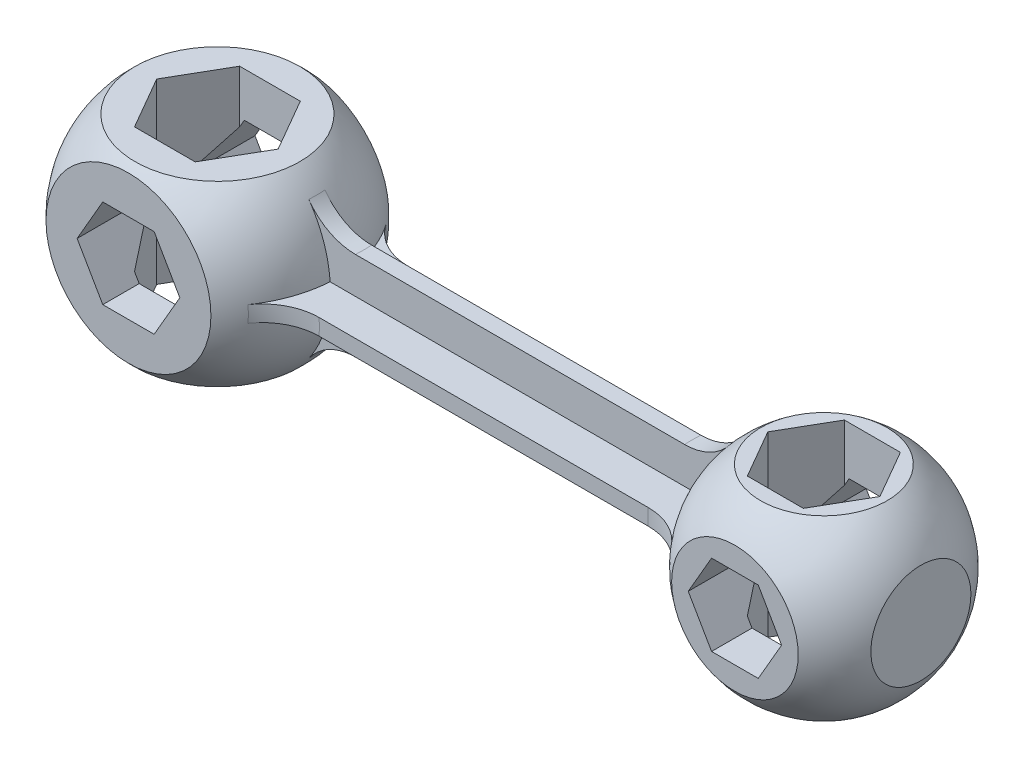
ISO-10303-21;
HEADER;
FILE_DESCRIPTION(('STEP AP214'),'2;1');
FILE_NAME('part.step','',(''),(''),'','','');
FILE_SCHEMA(('AUTOMOTIVE_DESIGN { 1 0 10303 214 1 1 1 1 }'));
ENDSEC;
DATA;
#1=APPLICATION_CONTEXT('core data for automotive mechanical design processes');
#2=APPLICATION_PROTOCOL_DEFINITION('international standard','automotive_design',2000,#1);
#3=PRODUCT_CONTEXT('',#1,'mechanical');
#4=PRODUCT('Part','Part','',(#3));
#5=PRODUCT_RELATED_PRODUCT_CATEGORY('part','',(#4));
#6=PRODUCT_DEFINITION_FORMATION('','',#4);
#7=PRODUCT_DEFINITION_CONTEXT('part definition',#1,'design');
#8=PRODUCT_DEFINITION('design','',#6,#7);
#9=PRODUCT_DEFINITION_SHAPE('','',#8);
#10=(LENGTH_UNIT() NAMED_UNIT(*) SI_UNIT(.MILLI.,.METRE.));
#11=(NAMED_UNIT(*) PLANE_ANGLE_UNIT() SI_UNIT($,.RADIAN.));
#12=(NAMED_UNIT(*) SI_UNIT($,.STERADIAN.) SOLID_ANGLE_UNIT());
#13=UNCERTAINTY_MEASURE_WITH_UNIT(LENGTH_MEASURE(1.E-05),#10,'distance_accuracy_value','');
#14=(GEOMETRIC_REPRESENTATION_CONTEXT(3) GLOBAL_UNCERTAINTY_ASSIGNED_CONTEXT((#13)) GLOBAL_UNIT_ASSIGNED_CONTEXT((#10,
#11,#12)) REPRESENTATION_CONTEXT('',''));
#15=CARTESIAN_POINT('',(0.,0.,0.));
#16=DIRECTION('',(0.,0.,1.));
#17=DIRECTION('',(1.,0.,0.));
#18=AXIS2_PLACEMENT_3D('',#15,#16,#17);
#19=CARTESIAN_POINT('',(72.1132486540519,5.,-15.));
#20=DIRECTION('',(-0.866025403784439,0.499999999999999,0.));
#21=DIRECTION('',(-0.499999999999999,-0.866025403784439,0.));
#22=AXIS2_PLACEMENT_3D('',#19,#20,#21);
#23=PLANE('',#22);
#24=DIRECTION('',(0.377964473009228,0.654653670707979,0.654653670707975));
#25=VECTOR('',#24,1.);
#26=CARTESIAN_POINT('',(66.6696604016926,-4.42857142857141,-2.42857142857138));
#27=LINE('',#26,#25);
#28=CARTESIAN_POINT('',(69.2264973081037,0.,1.99999999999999));
#29=VERTEX_POINT('',#28);
#30=CARTESIAN_POINT('',(71.5358983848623,4.00000000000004,6.));
#31=VERTEX_POINT('',#30);
#32=EDGE_CURVE('E497',#29,#31,#27,.T.);
#33=ORIENTED_EDGE('',*,*,#32,.T.);
#34=DIRECTION('',(0.499999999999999,0.866025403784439,0.));
#35=VECTOR('',#34,1.);
#36=CARTESIAN_POINT('',(72.1132486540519,5.,6.));
#37=LINE('',#36,#35);
#38=CARTESIAN_POINT('',(72.1132486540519,5.,6.));
#39=VERTEX_POINT('',#38);
#40=EDGE_CURVE('E515',#31,#39,#37,.T.);
#41=ORIENTED_EDGE('',*,*,#40,.T.);
#42=DIRECTION('',(0.,0.,1.));
#43=VECTOR('',#42,1.);
#44=CARTESIAN_POINT('',(72.1132486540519,5.,-15.));
#45=LINE('',#44,#43);
#46=CARTESIAN_POINT('',(72.1132486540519,5.,11.0000000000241));
#47=VERTEX_POINT('',#46);
#48=EDGE_CURVE('E555',#39,#47,#45,.T.);
#49=ORIENTED_EDGE('',*,*,#48,.T.);
#50=DIRECTION('',(-0.499999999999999,-0.866025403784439,0.));
#51=VECTOR('',#50,1.);
#52=CARTESIAN_POINT('',(72.1132486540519,5.,11.0000000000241));
#53=LINE('',#52,#51);
#54=CARTESIAN_POINT('',(69.2264973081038,0.,11.));
#55=VERTEX_POINT('',#54);
#56=EDGE_CURVE('E532',#47,#55,#53,.T.);
#57=ORIENTED_EDGE('',*,*,#56,.T.);
#58=DIRECTION('',(0.,0.,1.));
#59=VECTOR('',#58,1.);
#60=CARTESIAN_POINT('',(69.2264973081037,0.,-15.));
#61=LINE('',#60,#59);
#62=EDGE_CURVE('E550',#29,#55,#61,.T.);
#63=ORIENTED_EDGE('',*,*,#62,.F.);
#64=EDGE_LOOP('',(#33,#41,#49,#57,#63));
#65=FACE_BOUND('',#64,.T.);
#66=ADVANCED_FACE('F29',(#65),#23,.F.);
#67=CARTESIAN_POINT('',(77.8867513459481,5.,-15.));
#68=DIRECTION('',(0.,1.,0.));
#69=DIRECTION('',(0.,0.,1.));
#70=AXIS2_PLACEMENT_3D('',#67,#68,#69);
#71=PLANE('',#70);
#72=ORIENTED_EDGE('',*,*,#48,.F.);
#73=DIRECTION('',(1.,0.,0.));
#74=VECTOR('',#73,1.);
#75=CARTESIAN_POINT('',(77.8867513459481,5.,6.));
#76=LINE('',#75,#74);
#77=CARTESIAN_POINT('',(77.8867513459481,5.,6.));
#78=VERTEX_POINT('',#77);
#79=EDGE_CURVE('E512',#39,#78,#76,.T.);
#80=ORIENTED_EDGE('',*,*,#79,.T.);
#81=DIRECTION('',(0.,0.,1.));
#82=VECTOR('',#81,1.);
#83=CARTESIAN_POINT('',(77.8867513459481,5.,-15.));
#84=LINE('',#83,#82);
#85=CARTESIAN_POINT('',(77.8867513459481,5.,11.0000000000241));
#86=VERTEX_POINT('',#85);
#87=EDGE_CURVE('E559',#78,#86,#84,.T.);
#88=ORIENTED_EDGE('',*,*,#87,.T.);
#89=DIRECTION('',(-1.,0.,0.));
#90=VECTOR('',#89,1.);
#91=CARTESIAN_POINT('',(77.8867513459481,5.,11.0000000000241));
#92=LINE('',#91,#90);
#93=EDGE_CURVE('E547',#86,#47,#92,.T.);
#94=ORIENTED_EDGE('',*,*,#93,.T.);
#95=EDGE_LOOP('',(#72,#80,#88,#94));
#96=FACE_BOUND('',#95,.T.);
#97=ADVANCED_FACE('F926',(#96),#71,.F.);
#98=CARTESIAN_POINT('',(80.7735026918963,0.,-15.));
#99=DIRECTION('',(0.866025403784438,0.500000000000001,0.));
#100=DIRECTION('',(-0.500000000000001,0.866025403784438,0.));
#101=AXIS2_PLACEMENT_3D('',#98,#99,#100);
#102=PLANE('',#101);
#103=DIRECTION('',(0.500000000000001,-0.866025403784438,0.));
#104=VECTOR('',#103,1.);
#105=CARTESIAN_POINT('',(80.7735026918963,0.,6.));
#106=LINE('',#105,#104);
#107=CARTESIAN_POINT('',(78.4641016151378,4.,6.));
#108=VERTEX_POINT('',#107);
#109=EDGE_CURVE('E509',#78,#108,#106,.T.);
#110=ORIENTED_EDGE('',*,*,#109,.T.);
#111=DIRECTION('',(0.377964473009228,-0.654653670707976,-0.654653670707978));
#112=VECTOR('',#111,1.);
#113=CARTESIAN_POINT('',(84.9799117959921,-7.28571428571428,-5.28571428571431));
#114=LINE('',#113,#112);
#115=CARTESIAN_POINT('',(80.7735026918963,0.,2.));
#116=VERTEX_POINT('',#115);
#117=EDGE_CURVE('E526',#108,#116,#114,.T.);
#118=ORIENTED_EDGE('',*,*,#117,.T.);
#119=DIRECTION('',(0.,0.,1.));
#120=VECTOR('',#119,1.);
#121=CARTESIAN_POINT('',(80.7735026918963,0.,-15.));
#122=LINE('',#121,#120);
#123=CARTESIAN_POINT('',(80.7735026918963,0.,11.0000000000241));
#124=VERTEX_POINT('',#123);
#125=EDGE_CURVE('E563',#116,#124,#122,.T.);
#126=ORIENTED_EDGE('',*,*,#125,.T.);
#127=DIRECTION('',(-0.500000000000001,0.866025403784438,0.));
#128=VECTOR('',#127,1.);
#129=CARTESIAN_POINT('',(80.7735026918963,0.,11.0000000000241));
#130=LINE('',#129,#128);
#131=EDGE_CURVE('E544',#124,#86,#130,.T.);
#132=ORIENTED_EDGE('',*,*,#131,.T.);
#133=ORIENTED_EDGE('',*,*,#87,.F.);
#134=EDGE_LOOP('',(#110,#118,#126,#132,#133));
#135=FACE_BOUND('',#134,.T.);
#136=ADVANCED_FACE('F934',(#135),#102,.F.);
#137=CARTESIAN_POINT('',(77.8867513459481,-5.,-15.));
#138=DIRECTION('',(0.866025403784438,-0.500000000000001,0.));
#139=DIRECTION('',(0.500000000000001,0.866025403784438,0.));
#140=AXIS2_PLACEMENT_3D('',#137,#138,#139);
#141=PLANE('',#140);
#142=ORIENTED_EDGE('',*,*,#125,.F.);
#143=DIRECTION('',(-0.377964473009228,-0.654653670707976,0.654653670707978));
#144=VECTOR('',#143,1.);
#145=CARTESIAN_POINT('',(83.3303395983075,4.42857142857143,-2.42857142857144));
#146=LINE('',#145,#144);
#147=CARTESIAN_POINT('',(78.4641016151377,-4.00000000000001,6.));
#148=VERTEX_POINT('',#147);
#149=EDGE_CURVE('E12',#116,#148,#146,.T.);
#150=ORIENTED_EDGE('',*,*,#149,.T.);
#151=DIRECTION('',(-0.500000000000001,-0.866025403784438,0.));
#152=VECTOR('',#151,1.);
#153=CARTESIAN_POINT('',(77.8867513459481,-5.,6.));
#154=LINE('',#153,#152);
#155=CARTESIAN_POINT('',(77.8867513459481,-5.,6.));
#156=VERTEX_POINT('',#155);
#157=EDGE_CURVE('E506',#148,#156,#154,.T.);
#158=ORIENTED_EDGE('',*,*,#157,.T.);
#159=DIRECTION('',(0.,0.,1.));
#160=VECTOR('',#159,1.);
#161=CARTESIAN_POINT('',(77.8867513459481,-5.,-15.));
#162=LINE('',#161,#160);
#163=CARTESIAN_POINT('',(77.8867513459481,-5.,11.0000000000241));
#164=VERTEX_POINT('',#163);
#165=EDGE_CURVE('E567',#156,#164,#162,.T.);
#166=ORIENTED_EDGE('',*,*,#165,.T.);
#167=DIRECTION('',(0.500000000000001,0.866025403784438,0.));
#168=VECTOR('',#167,1.);
#169=CARTESIAN_POINT('',(77.8867513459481,-5.,11.0000000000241));
#170=LINE('',#169,#168);
#171=EDGE_CURVE('E541',#164,#124,#170,.T.);
#172=ORIENTED_EDGE('',*,*,#171,.T.);
#173=EDGE_LOOP('',(#142,#150,#158,#166,#172));
#174=FACE_BOUND('',#173,.T.);
#175=ADVANCED_FACE('F1024',(#174),#141,.F.);
#176=CARTESIAN_POINT('',(72.1132486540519,-5.,-15.));
#177=DIRECTION('',(0.,-1.,0.));
#178=DIRECTION('',(1.,0.,0.));
#179=AXIS2_PLACEMENT_3D('',#176,#177,#178);
#180=PLANE('',#179);
#181=ORIENTED_EDGE('',*,*,#165,.F.);
#182=DIRECTION('',(-1.,0.,0.));
#183=VECTOR('',#182,1.);
#184=CARTESIAN_POINT('',(72.1132486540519,-5.,6.));
#185=LINE('',#184,#183);
#186=CARTESIAN_POINT('',(72.1132486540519,-5.,6.));
#187=VERTEX_POINT('',#186);
#188=EDGE_CURVE('E503',#156,#187,#185,.T.);
#189=ORIENTED_EDGE('',*,*,#188,.T.);
#190=DIRECTION('',(0.,0.,1.));
#191=VECTOR('',#190,1.);
#192=CARTESIAN_POINT('',(72.1132486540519,-5.,-15.));
#193=LINE('',#192,#191);
#194=CARTESIAN_POINT('',(72.1132486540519,-5.,11.0000000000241));
#195=VERTEX_POINT('',#194);
#196=EDGE_CURVE('E571',#187,#195,#193,.T.);
#197=ORIENTED_EDGE('',*,*,#196,.T.);
#198=DIRECTION('',(1.,0.,0.));
#199=VECTOR('',#198,1.);
#200=CARTESIAN_POINT('',(72.1132486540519,-5.,11.0000000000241));
#201=LINE('',#200,#199);
#202=EDGE_CURVE('E538',#195,#164,#201,.T.);
#203=ORIENTED_EDGE('',*,*,#202,.T.);
#204=EDGE_LOOP('',(#181,#189,#197,#203));
#205=FACE_BOUND('',#204,.T.);
#206=ADVANCED_FACE('F1020',(#205),#180,.F.);
#207=CARTESIAN_POINT('',(69.2264973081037,0.,-15.));
#208=DIRECTION('',(-0.866025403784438,-0.500000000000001,0.));
#209=DIRECTION('',(0.500000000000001,-0.866025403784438,0.));
#210=AXIS2_PLACEMENT_3D('',#207,#208,#209);
#211=PLANE('',#210);
#212=ORIENTED_EDGE('',*,*,#196,.F.);
#213=DIRECTION('',(-0.500000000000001,0.866025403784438,0.));
#214=VECTOR('',#213,1.);
#215=CARTESIAN_POINT('',(69.2264973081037,0.,6.));
#216=LINE('',#215,#214);
#217=CARTESIAN_POINT('',(71.5358983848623,-4.00000000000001,6.));
#218=VERTEX_POINT('',#217);
#219=EDGE_CURVE('E985',#187,#218,#216,.T.);
#220=ORIENTED_EDGE('',*,*,#219,.T.);
#221=DIRECTION('',(-0.377964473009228,0.654653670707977,-0.654653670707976));
#222=VECTOR('',#221,1.);
#223=CARTESIAN_POINT('',(65.0200882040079,7.28571428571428,-5.28571428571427));
#224=LINE('',#223,#222);
#225=EDGE_CURVE('E982',#218,#29,#224,.T.);
#226=ORIENTED_EDGE('',*,*,#225,.T.);
#227=ORIENTED_EDGE('',*,*,#62,.T.);
#228=DIRECTION('',(0.500000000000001,-0.866025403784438,0.));
#229=VECTOR('',#228,1.);
#230=CARTESIAN_POINT('',(69.2264973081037,0.,11.0000000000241));
#231=LINE('',#230,#229);
#232=EDGE_CURVE('E535',#55,#195,#231,.T.);
#233=ORIENTED_EDGE('',*,*,#232,.T.);
#234=EDGE_LOOP('',(#212,#220,#226,#227,#233));
#235=FACE_BOUND('',#234,.T.);
#236=ADVANCED_FACE('F1016',(#235),#211,.F.);
#237=CARTESIAN_POINT('',(-3.75277674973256,-15.,6.5));
#238=DIRECTION('',(0.,0.,1.));
#239=DIRECTION('',(1.,0.,0.));
#240=AXIS2_PLACEMENT_3D('',#237,#238,#239);
#241=PLANE('',#240);
#242=DIRECTION('',(-1.,0.,0.));
#243=VECTOR('',#242,1.);
#244=CARTESIAN_POINT('',(-3.75277674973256,5.50000000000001,6.5));
#245=LINE('',#244,#243);
#246=CARTESIAN_POINT('',(3.17542648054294,5.50000000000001,6.5));
#247=VERTEX_POINT('',#246);
#248=CARTESIAN_POINT('',(-3.17542648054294,5.50000000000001,6.5));
#249=VERTEX_POINT('',#248);
#250=EDGE_CURVE('E649',#247,#249,#245,.T.);
#251=ORIENTED_EDGE('',*,*,#250,.T.);
#252=DIRECTION('',(-0.5,-0.866025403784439,0.));
#253=VECTOR('',#252,1.);
#254=CARTESIAN_POINT('',(-12.1965244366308,-10.125,6.5));
#255=LINE('',#254,#253);
#256=CARTESIAN_POINT('',(-3.75277674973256,4.50000000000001,6.5));
#257=VERTEX_POINT('',#256);
#258=EDGE_CURVE('E660',#249,#257,#255,.T.);
#259=ORIENTED_EDGE('',*,*,#258,.T.);
#260=DIRECTION('',(0.,1.,0.));
#261=VECTOR('',#260,1.);
#262=CARTESIAN_POINT('',(-3.75277674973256,-15.,6.5));
#263=LINE('',#262,#261);
#264=CARTESIAN_POINT('',(-3.75277674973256,10.9999999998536,6.5));
#265=VERTEX_POINT('',#264);
#266=EDGE_CURVE('E691',#257,#265,#263,.T.);
#267=ORIENTED_EDGE('',*,*,#266,.T.);
#268=DIRECTION('',(1.,0.,0.));
#269=VECTOR('',#268,1.);
#270=CARTESIAN_POINT('',(-3.75277674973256,10.9999999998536,6.5));
#271=LINE('',#270,#269);
#272=CARTESIAN_POINT('',(3.75277674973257,10.9999999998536,6.5));
#273=VERTEX_POINT('',#272);
#274=EDGE_CURVE('E679',#265,#273,#271,.T.);
#275=ORIENTED_EDGE('',*,*,#274,.T.);
#276=DIRECTION('',(0.,1.,0.));
#277=VECTOR('',#276,1.);
#278=CARTESIAN_POINT('',(3.75277674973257,-15.,6.5));
#279=LINE('',#278,#277);
#280=CARTESIAN_POINT('',(3.75277674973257,4.50000000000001,6.5));
#281=VERTEX_POINT('',#280);
#282=EDGE_CURVE('E687',#281,#273,#279,.T.);
#283=ORIENTED_EDGE('',*,*,#282,.F.);
#284=DIRECTION('',(-0.5,0.866025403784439,0.));
#285=VECTOR('',#284,1.);
#286=CARTESIAN_POINT('',(10.3201360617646,-6.875,6.5));
#287=LINE('',#286,#285);
#288=EDGE_CURVE('E624',#281,#247,#287,.T.);
#289=ORIENTED_EDGE('',*,*,#288,.T.);
#290=EDGE_LOOP('',(#251,#259,#267,#275,#283,#289));
#291=FACE_BOUND('',#290,.T.);
#292=ADVANCED_FACE('F1139',(#291),#241,.F.);
#293=CARTESIAN_POINT('',(3.75277674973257,-15.,-6.5));
#294=DIRECTION('',(0.,0.,-1.));
#295=DIRECTION('',(-1.,0.,0.));
#296=AXIS2_PLACEMENT_3D('',#293,#294,#295);
#297=PLANE('',#296);
#298=DIRECTION('',(0.,1.,0.));
#299=VECTOR('',#298,1.);
#300=CARTESIAN_POINT('',(-3.75277674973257,-15.,-6.5));
#301=LINE('',#300,#299);
#302=CARTESIAN_POINT('',(-3.75277674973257,4.50000000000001,-6.5));
#303=VERTEX_POINT('',#302);
#304=CARTESIAN_POINT('',(-3.75277674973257,10.9999999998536,-6.5));
#305=VERTEX_POINT('',#304);
#306=EDGE_CURVE('E697',#303,#305,#301,.T.);
#307=ORIENTED_EDGE('',*,*,#306,.F.);
#308=DIRECTION('',(0.5,0.866025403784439,0.));
#309=VECTOR('',#308,1.);
#310=CARTESIAN_POINT('',(-10.3201360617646,-6.875,-6.5));
#311=LINE('',#310,#309);
#312=CARTESIAN_POINT('',(-3.17542648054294,5.50000000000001,-6.5));
#313=VERTEX_POINT('',#312);
#314=EDGE_CURVE('E1652',#303,#313,#311,.T.);
#315=ORIENTED_EDGE('',*,*,#314,.T.);
#316=DIRECTION('',(1.,0.,0.));
#317=VECTOR('',#316,1.);
#318=CARTESIAN_POINT('',(3.75277674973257,5.50000000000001,-6.5));
#319=LINE('',#318,#317);
#320=CARTESIAN_POINT('',(3.17542648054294,5.50000000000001,-6.5));
#321=VERTEX_POINT('',#320);
#322=EDGE_CURVE('E1649',#313,#321,#319,.T.);
#323=ORIENTED_EDGE('',*,*,#322,.T.);
#324=DIRECTION('',(0.5,-0.866025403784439,0.));
#325=VECTOR('',#324,1.);
#326=CARTESIAN_POINT('',(12.1965244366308,-10.125,-6.5));
#327=LINE('',#326,#325);
#328=CARTESIAN_POINT('',(3.75277674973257,4.5,-6.5));
#329=VERTEX_POINT('',#328);
#330=EDGE_CURVE('E621',#321,#329,#327,.T.);
#331=ORIENTED_EDGE('',*,*,#330,.T.);
#332=DIRECTION('',(0.,1.,0.));
#333=VECTOR('',#332,1.);
#334=CARTESIAN_POINT('',(3.75277674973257,-15.,-6.5));
#335=LINE('',#334,#333);
#336=CARTESIAN_POINT('',(3.75277674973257,10.9999999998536,-6.5));
#337=VERTEX_POINT('',#336);
#338=EDGE_CURVE('E701',#329,#337,#335,.T.);
#339=ORIENTED_EDGE('',*,*,#338,.T.);
#340=DIRECTION('',(-1.,0.,0.));
#341=VECTOR('',#340,1.);
#342=CARTESIAN_POINT('',(3.75277674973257,10.9999999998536,-6.5));
#343=LINE('',#342,#341);
#344=EDGE_CURVE('E670',#337,#305,#343,.T.);
#345=ORIENTED_EDGE('',*,*,#344,.T.);
#346=EDGE_LOOP('',(#307,#315,#323,#331,#339,#345));
#347=FACE_BOUND('',#346,.T.);
#348=ADVANCED_FACE('F921',(#347),#297,.F.);
#349=CARTESIAN_POINT('',(0.,0.,0.));
#350=DIRECTION('',(1.,0.,0.));
#351=DIRECTION('',(0.,0.,1.));
#352=AXIS2_PLACEMENT_3D('',#349,#350,#351);
#353=SPHERICAL_SURFACE('',#352,15.);
#354=CARTESIAN_POINT('',(0.,0.,-11.));
#355=DIRECTION('',(0.,0.,-1.));
#356=DIRECTION('',(-1.,0.,0.));
#357=AXIS2_PLACEMENT_3D('',#354,#355,#356);
#358=CIRCLE('',#357,10.1980390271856);
#359=CARTESIAN_POINT('',(-10.1980390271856,0.,-11.));
#360=VERTEX_POINT('',#359);
#361=EDGE_CURVE('E708',#360,#360,#358,.F.);
#362=ORIENTED_EDGE('',*,*,#361,.T.);
#363=EDGE_LOOP('',(#362));
#364=FACE_BOUND('',#363,.T.);
#365=CARTESIAN_POINT('',(-13.,0.,0.));
#366=DIRECTION('',(-1.,0.,0.));
#367=DIRECTION('',(0.,0.,1.));
#368=AXIS2_PLACEMENT_3D('',#365,#366,#367);
#369=CIRCLE('',#368,7.48331477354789);
#370=CARTESIAN_POINT('',(-13.,0.,7.48331477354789));
#371=VERTEX_POINT('',#370);
#372=EDGE_CURVE('E796',#371,#371,#369,.F.);
#373=ORIENTED_EDGE('',*,*,#372,.T.);
#374=EDGE_LOOP('',(#373));
#375=FACE_BOUND('',#374,.T.);
#376=CARTESIAN_POINT('',(0.,0.,-1.));
#377=DIRECTION('',(0.,0.,-1.));
#378=DIRECTION('',(0.,1.,0.));
#379=AXIS2_PLACEMENT_3D('',#376,#377,#378);
#380=CIRCLE('',#379,14.9666295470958);
#381=CARTESIAN_POINT('',(12.3029719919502,-8.52272727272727,-1.00000000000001));
#382=VERTEX_POINT('',#381);
#383=CARTESIAN_POINT('',(14.9331845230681,-0.999999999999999,-1.));
#384=VERTEX_POINT('',#383);
#385=EDGE_CURVE('E768',#382,#384,#380,.F.);
#386=ORIENTED_EDGE('',*,*,#385,.F.);
#387=CARTESIAN_POINT('',(0.,-8.52272727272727,0.));
#388=DIRECTION('',(0.,1.,0.));
#389=DIRECTION('',(0.,0.,1.));
#390=AXIS2_PLACEMENT_3D('',#387,#388,#389);
#391=CIRCLE('',#390,12.343545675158);
#392=CARTESIAN_POINT('',(12.3029719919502,-8.52272727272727,0.999999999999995));
#393=VERTEX_POINT('',#392);
#394=EDGE_CURVE('E846',#382,#393,#391,.F.);
#395=ORIENTED_EDGE('',*,*,#394,.T.);
#396=CARTESIAN_POINT('',(0.,0.,0.999999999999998));
#397=DIRECTION('',(0.,0.,-1.));
#398=DIRECTION('',(0.,1.,0.));
#399=AXIS2_PLACEMENT_3D('',#396,#397,#398);
#400=CIRCLE('',#399,14.9666295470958);
#401=CARTESIAN_POINT('',(14.9331845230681,-0.999999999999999,0.999999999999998));
#402=VERTEX_POINT('',#401);
#403=EDGE_CURVE('E764',#393,#402,#400,.F.);
#404=ORIENTED_EDGE('',*,*,#403,.T.);
#405=CARTESIAN_POINT('',(0.,-0.999999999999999,0.));
#406=DIRECTION('',(0.,1.,0.));
#407=DIRECTION('',(0.,0.,1.));
#408=AXIS2_PLACEMENT_3D('',#405,#406,#407);
#409=CIRCLE('',#408,14.9666295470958);
#410=CARTESIAN_POINT('',(12.3029719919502,-1.,8.52272727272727));
#411=VERTEX_POINT('',#410);
#412=EDGE_CURVE('E771',#402,#411,#409,.F.);
#413=ORIENTED_EDGE('',*,*,#412,.T.);
#414=CARTESIAN_POINT('',(0.,0.,8.52272727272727));
#415=DIRECTION('',(0.,0.,-1.));
#416=DIRECTION('',(-1.,0.,0.));
#417=AXIS2_PLACEMENT_3D('',#414,#415,#416);
#418=CIRCLE('',#417,12.343545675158);
#419=CARTESIAN_POINT('',(12.3029719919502,1.,8.52272727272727));
#420=VERTEX_POINT('',#419);
#421=EDGE_CURVE('E840',#411,#420,#418,.F.);
#422=ORIENTED_EDGE('',*,*,#421,.T.);
#423=CARTESIAN_POINT('',(0.,1.,0.));
#424=DIRECTION('',(0.,1.,0.));
#425=DIRECTION('',(0.,0.,1.));
#426=AXIS2_PLACEMENT_3D('',#423,#424,#425);
#427=CIRCLE('',#426,14.9666295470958);
#428=CARTESIAN_POINT('',(14.9331845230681,1.,0.999999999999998));
#429=VERTEX_POINT('',#428);
#430=EDGE_CURVE('E773',#429,#420,#427,.F.);
#431=ORIENTED_EDGE('',*,*,#430,.F.);
#432=CARTESIAN_POINT('',(12.3029719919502,8.52272727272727,1.));
#433=VERTEX_POINT('',#432);
#434=EDGE_CURVE('E763',#429,#433,#400,.F.);
#435=ORIENTED_EDGE('',*,*,#434,.T.);
#436=CARTESIAN_POINT('',(0.,8.52272727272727,0.));
#437=DIRECTION('',(0.,-1.,0.));
#438=DIRECTION('',(0.,0.,-1.));
#439=AXIS2_PLACEMENT_3D('',#436,#437,#438);
#440=CIRCLE('',#439,12.343545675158);
#441=CARTESIAN_POINT('',(12.3029719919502,8.52272727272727,-0.999999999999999));
#442=VERTEX_POINT('',#441);
#443=EDGE_CURVE('E837',#433,#442,#440,.F.);
#444=ORIENTED_EDGE('',*,*,#443,.T.);
#445=CARTESIAN_POINT('',(14.9331845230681,1.,-1.));
#446=VERTEX_POINT('',#445);
#447=EDGE_CURVE('E767',#446,#442,#380,.F.);
#448=ORIENTED_EDGE('',*,*,#447,.F.);
#449=CARTESIAN_POINT('',(12.3029719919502,1.,-8.52272727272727));
#450=VERTEX_POINT('',#449);
#451=EDGE_CURVE('E776',#450,#446,#427,.F.);
#452=ORIENTED_EDGE('',*,*,#451,.F.);
#453=CARTESIAN_POINT('',(0.,0.,-8.52272727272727));
#454=DIRECTION('',(0.,0.,1.));
#455=DIRECTION('',(1.,0.,0.));
#456=AXIS2_PLACEMENT_3D('',#453,#454,#455);
#457=CIRCLE('',#456,12.343545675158);
#458=CARTESIAN_POINT('',(12.3029719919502,-0.999999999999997,-8.52272727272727));
#459=VERTEX_POINT('',#458);
#460=EDGE_CURVE('E843',#450,#459,#457,.F.);
#461=ORIENTED_EDGE('',*,*,#460,.T.);
#462=EDGE_CURVE('E774',#459,#384,#409,.F.);
#463=ORIENTED_EDGE('',*,*,#462,.T.);
#464=EDGE_LOOP('',(#386,#395,#404,#413,#422,#431,#435,#444,#448,#452,#461,#463));
#465=FACE_BOUND('',#464,.T.);
#466=CARTESIAN_POINT('',(0.,11.,0.));
#467=DIRECTION('',(0.,-1.,0.));
#468=DIRECTION('',(0.,0.,-1.));
#469=AXIS2_PLACEMENT_3D('',#466,#467,#468);
#470=CIRCLE('',#469,10.1980390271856);
#471=CARTESIAN_POINT('',(0.,11.,-10.1980390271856));
#472=VERTEX_POINT('',#471);
#473=EDGE_CURVE('E785',#472,#472,#470,.F.);
#474=ORIENTED_EDGE('',*,*,#473,.F.);
#475=EDGE_LOOP('',(#474));
#476=FACE_BOUND('',#475,.T.);
#477=CARTESIAN_POINT('',(0.,-11.,0.));
#478=DIRECTION('',(0.,1.,0.));
#479=DIRECTION('',(0.,0.,1.));
#480=AXIS2_PLACEMENT_3D('',#477,#478,#479);
#481=CIRCLE('',#480,10.1980390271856);
#482=CARTESIAN_POINT('',(0.,-11.,10.1980390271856));
#483=VERTEX_POINT('',#482);
#484=EDGE_CURVE('E788',#483,#483,#481,.F.);
#485=ORIENTED_EDGE('',*,*,#484,.F.);
#486=EDGE_LOOP('',(#485));
#487=FACE_BOUND('',#486,.T.);
#488=CARTESIAN_POINT('',(0.,0.,11.));
#489=DIRECTION('',(0.,0.,1.));
#490=DIRECTION('',(1.,0.,0.));
#491=AXIS2_PLACEMENT_3D('',#488,#489,#490);
#492=CIRCLE('',#491,10.1980390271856);
#493=CARTESIAN_POINT('',(10.1980390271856,0.,11.));
#494=VERTEX_POINT('',#493);
#495=EDGE_CURVE('E704',#494,#494,#492,.F.);
#496=ORIENTED_EDGE('',*,*,#495,.T.);
#497=EDGE_LOOP('',(#496));
#498=FACE_BOUND('',#497,.T.);
#499=ADVANCED_FACE('F31',(#364,#375,#465,#476,#487,#498),#353,.T.);
#500=CARTESIAN_POINT('',(75.,0.,0.));
#501=DIRECTION('',(0.,0.,1.));
#502=DIRECTION('',(0.,1.,0.));
#503=AXIS2_PLACEMENT_3D('',#500,#501,#502);
#504=SPHERICAL_SURFACE('',#503,13.5);
#505=CARTESIAN_POINT('',(75.,0.,-11.));
#506=DIRECTION('',(0.,0.,-1.));
#507=DIRECTION('',(-1.,0.,0.));
#508=AXIS2_PLACEMENT_3D('',#505,#506,#507);
#509=CIRCLE('',#508,7.82623792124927);
#510=CARTESIAN_POINT('',(67.1737620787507,0.,-11.));
#511=VERTEX_POINT('',#510);
#512=EDGE_CURVE('E707',#511,#511,#509,.T.);
#513=ORIENTED_EDGE('',*,*,#512,.F.);
#514=EDGE_LOOP('',(#513));
#515=FACE_BOUND('',#514,.T.);
#516=CARTESIAN_POINT('',(87.,0.,0.));
#517=DIRECTION('',(1.,0.,0.));
#518=DIRECTION('',(0.,0.,-1.));
#519=AXIS2_PLACEMENT_3D('',#516,#517,#518);
#520=CIRCLE('',#519,6.1846584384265);
#521=CARTESIAN_POINT('',(87.,0.,-6.1846584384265));
#522=VERTEX_POINT('',#521);
#523=EDGE_CURVE('E791',#522,#522,#520,.T.);
#524=ORIENTED_EDGE('',*,*,#523,.F.);
#525=EDGE_LOOP('',(#524));
#526=FACE_BOUND('',#525,.T.);
#527=CARTESIAN_POINT('',(75.,-0.999999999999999,0.));
#528=DIRECTION('',(0.,1.,0.));
#529=DIRECTION('',(0.,0.,1.));
#530=AXIS2_PLACEMENT_3D('',#527,#528,#529);
#531=CIRCLE('',#530,13.4629120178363);
#532=CARTESIAN_POINT('',(61.5742784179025,-0.999999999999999,-1.));
#533=VERTEX_POINT('',#532);
#534=CARTESIAN_POINT('',(64.3468786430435,-0.999999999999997,-8.23170731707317));
#535=VERTEX_POINT('',#534);
#536=EDGE_CURVE('E777',#533,#535,#531,.F.);
#537=ORIENTED_EDGE('',*,*,#536,.T.);
#538=CARTESIAN_POINT('',(75.,0.,-8.23170731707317));
#539=DIRECTION('',(0.,0.,1.));
#540=DIRECTION('',(1.,0.,0.));
#541=AXIS2_PLACEMENT_3D('',#538,#539,#540);
#542=CIRCLE('',#541,10.69995302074);
#543=CARTESIAN_POINT('',(64.3468786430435,1.,-8.23170731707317));
#544=VERTEX_POINT('',#543);
#545=EDGE_CURVE('E816',#535,#544,#542,.F.);
#546=ORIENTED_EDGE('',*,*,#545,.T.);
#547=CARTESIAN_POINT('',(75.,1.,0.));
#548=DIRECTION('',(0.,1.,0.));
#549=DIRECTION('',(0.,0.,1.));
#550=AXIS2_PLACEMENT_3D('',#547,#548,#549);
#551=CIRCLE('',#550,13.4629120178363);
#552=CARTESIAN_POINT('',(61.5742784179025,1.,-1.));
#553=VERTEX_POINT('',#552);
#554=EDGE_CURVE('E711',#553,#544,#551,.F.);
#555=ORIENTED_EDGE('',*,*,#554,.F.);
#556=CARTESIAN_POINT('',(75.,0.,-1.));
#557=DIRECTION('',(0.,0.,-1.));
#558=DIRECTION('',(0.,1.,0.));
#559=AXIS2_PLACEMENT_3D('',#556,#557,#558);
#560=CIRCLE('',#559,13.4629120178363);
#561=CARTESIAN_POINT('',(64.3468786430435,8.23170731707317,-0.999999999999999));
#562=VERTEX_POINT('',#561);
#563=EDGE_CURVE('E713',#562,#553,#560,.F.);
#564=ORIENTED_EDGE('',*,*,#563,.F.);
#565=CARTESIAN_POINT('',(75.,8.23170731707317,0.));
#566=DIRECTION('',(0.,-1.,0.));
#567=DIRECTION('',(0.,0.,-1.));
#568=AXIS2_PLACEMENT_3D('',#565,#566,#567);
#569=CIRCLE('',#568,10.69995302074);
#570=CARTESIAN_POINT('',(64.3468786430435,8.23170731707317,1.));
#571=VERTEX_POINT('',#570);
#572=EDGE_CURVE('E813',#562,#571,#569,.F.);
#573=ORIENTED_EDGE('',*,*,#572,.T.);
#574=CARTESIAN_POINT('',(75.,0.,0.999999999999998));
#575=DIRECTION('',(0.,0.,-1.));
#576=DIRECTION('',(0.,1.,0.));
#577=AXIS2_PLACEMENT_3D('',#574,#575,#576);
#578=CIRCLE('',#577,13.4629120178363);
#579=CARTESIAN_POINT('',(61.5742784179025,1.,0.999999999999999));
#580=VERTEX_POINT('',#579);
#581=EDGE_CURVE('E717',#571,#580,#578,.F.);
#582=ORIENTED_EDGE('',*,*,#581,.T.);
#583=CARTESIAN_POINT('',(75.,1.,0.));
#584=DIRECTION('',(0.,1.,0.));
#585=DIRECTION('',(0.,0.,1.));
#586=AXIS2_PLACEMENT_3D('',#583,#584,#585);
#587=CIRCLE('',#586,13.4629120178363);
#588=CARTESIAN_POINT('',(64.3468786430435,1.,8.23170731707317));
#589=VERTEX_POINT('',#588);
#590=EDGE_CURVE('E722',#589,#580,#587,.F.);
#591=ORIENTED_EDGE('',*,*,#590,.F.);
#592=CARTESIAN_POINT('',(75.,0.,8.23170731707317));
#593=DIRECTION('',(0.,0.,-1.));
#594=DIRECTION('',(-1.,0.,0.));
#595=AXIS2_PLACEMENT_3D('',#592,#593,#594);
#596=CIRCLE('',#595,10.69995302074);
#597=CARTESIAN_POINT('',(64.3468786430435,-1.,8.23170731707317));
#598=VERTEX_POINT('',#597);
#599=EDGE_CURVE('E810',#589,#598,#596,.F.);
#600=ORIENTED_EDGE('',*,*,#599,.T.);
#601=CARTESIAN_POINT('',(75.,-0.999999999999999,0.));
#602=DIRECTION('',(0.,1.,0.));
#603=DIRECTION('',(0.,0.,1.));
#604=AXIS2_PLACEMENT_3D('',#601,#602,#603);
#605=CIRCLE('',#604,13.4629120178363);
#606=CARTESIAN_POINT('',(61.5742784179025,-0.999999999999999,0.999999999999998));
#607=VERTEX_POINT('',#606);
#608=EDGE_CURVE('E724',#598,#607,#605,.F.);
#609=ORIENTED_EDGE('',*,*,#608,.T.);
#610=CARTESIAN_POINT('',(75.,0.,0.999999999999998));
#611=DIRECTION('',(0.,0.,-1.));
#612=DIRECTION('',(0.,1.,0.));
#613=AXIS2_PLACEMENT_3D('',#610,#611,#612);
#614=CIRCLE('',#613,13.4629120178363);
#615=CARTESIAN_POINT('',(64.3468786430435,-8.23170731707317,0.999999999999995));
#616=VERTEX_POINT('',#615);
#617=EDGE_CURVE('E720',#607,#616,#614,.F.);
#618=ORIENTED_EDGE('',*,*,#617,.T.);
#619=CARTESIAN_POINT('',(75.,-8.23170731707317,0.));
#620=DIRECTION('',(0.,1.,0.));
#621=DIRECTION('',(0.,0.,1.));
#622=AXIS2_PLACEMENT_3D('',#619,#620,#621);
#623=CIRCLE('',#622,10.69995302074);
#624=CARTESIAN_POINT('',(64.3468786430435,-8.23170731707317,-1.));
#625=VERTEX_POINT('',#624);
#626=EDGE_CURVE('E807',#616,#625,#623,.F.);
#627=ORIENTED_EDGE('',*,*,#626,.T.);
#628=CARTESIAN_POINT('',(75.,0.,-1.));
#629=DIRECTION('',(0.,0.,-1.));
#630=DIRECTION('',(0.,1.,0.));
#631=AXIS2_PLACEMENT_3D('',#628,#629,#630);
#632=CIRCLE('',#631,13.4629120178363);
#633=EDGE_CURVE('E715',#533,#625,#632,.F.);
#634=ORIENTED_EDGE('',*,*,#633,.F.);
#635=EDGE_LOOP('',(#537,#546,#555,#564,#573,#582,#591,#600,#609,#618,#627,#634));
#636=FACE_BOUND('',#635,.T.);
#637=CARTESIAN_POINT('',(75.,11.,0.));
#638=DIRECTION('',(0.,-1.,0.));
#639=DIRECTION('',(0.,0.,-1.));
#640=AXIS2_PLACEMENT_3D('',#637,#638,#639);
#641=CIRCLE('',#640,7.82623792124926);
#642=CARTESIAN_POINT('',(75.,11.,-7.82623792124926));
#643=VERTEX_POINT('',#642);
#644=EDGE_CURVE('E779',#643,#643,#641,.T.);
#645=ORIENTED_EDGE('',*,*,#644,.T.);
#646=EDGE_LOOP('',(#645));
#647=FACE_BOUND('',#646,.T.);
#648=CARTESIAN_POINT('',(75.,-11.,0.));
#649=DIRECTION('',(0.,1.,0.));
#650=DIRECTION('',(0.,0.,1.));
#651=AXIS2_PLACEMENT_3D('',#648,#649,#650);
#652=CIRCLE('',#651,7.82623792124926);
#653=CARTESIAN_POINT('',(75.,-11.,7.82623792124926));
#654=VERTEX_POINT('',#653);
#655=EDGE_CURVE('E782',#654,#654,#652,.T.);
#656=ORIENTED_EDGE('',*,*,#655,.T.);
#657=EDGE_LOOP('',(#656));
#658=FACE_BOUND('',#657,.T.);
#659=CARTESIAN_POINT('',(75.,0.,11.));
#660=DIRECTION('',(0.,0.,1.));
#661=DIRECTION('',(1.,0.,0.));
#662=AXIS2_PLACEMENT_3D('',#659,#660,#661);
#663=CIRCLE('',#662,7.82623792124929);
#664=CARTESIAN_POINT('',(82.8262379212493,0.,11.));
#665=VERTEX_POINT('',#664);
#666=EDGE_CURVE('E686',#665,#665,#663,.T.);
#667=ORIENTED_EDGE('',*,*,#666,.F.);
#668=EDGE_LOOP('',(#667));
#669=FACE_BOUND('',#668,.T.);
#670=ADVANCED_FACE('F909',(#515,#526,#636,#647,#658,#669),#504,.T.);
#671=CARTESIAN_POINT('',(86.180339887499,5.5,-1.));
#672=DIRECTION('',(0.,0.,-1.));
#673=DIRECTION('',(0.,1.,0.));
#674=AXIS2_PLACEMENT_3D('',#671,#672,#673);
#675=PLANE('',#674);
#676=DIRECTION('',(1.,0.,0.));
#677=VECTOR('',#676,1.);
#678=CARTESIAN_POINT('',(86.180339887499,-0.999999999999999,-1.));
#679=LINE('',#678,#677);
#680=EDGE_CURVE('E742',#384,#533,#679,.T.);
#681=ORIENTED_EDGE('',*,*,#680,.T.);
#682=ORIENTED_EDGE('',*,*,#633,.T.);
#683=CARTESIAN_POINT('',(64.3468786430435,-8.23170731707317,-1.));
#684=CARTESIAN_POINT('',(64.2259920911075,-8.07522744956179,-1.));
#685=CARTESIAN_POINT('',(64.0984612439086,-7.92388730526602,-1.));
#686=CARTESIAN_POINT('',(63.8311054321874,-7.63249840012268,-1.));
#687=CARTESIAN_POINT('',(63.6912810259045,-7.49244912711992,-1.));
#688=CARTESIAN_POINT('',(63.400423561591,-7.22473353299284,-1.));
#689=CARTESIAN_POINT('',(63.2493984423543,-7.097058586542,-1.));
#690=CARTESIAN_POINT('',(62.9371409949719,-6.85487819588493,-1.));
#691=CARTESIAN_POINT('',(62.7759089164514,-6.74037242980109,-1.));
#692=CARTESIAN_POINT('',(62.4442644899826,-6.52526076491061,-1.));
#693=CARTESIAN_POINT('',(62.2738458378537,-6.42466458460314,-1.));
#694=CARTESIAN_POINT('',(61.9251445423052,-6.23817740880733,-1.));
#695=CARTESIAN_POINT('',(61.7468618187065,-6.15228656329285,-1.));
#696=CARTESIAN_POINT('',(61.3838083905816,-5.99587197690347,-1.));
#697=CARTESIAN_POINT('',(61.1990420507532,-5.92533811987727,-1.));
#698=CARTESIAN_POINT('',(60.824302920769,-5.80008494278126,-1.));
#699=CARTESIAN_POINT('',(60.6343312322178,-5.74536230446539,-1.));
#700=CARTESIAN_POINT('',(60.1709278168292,-5.6328033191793,-1.));
#701=CARTESIAN_POINT('',(59.895469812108,-5.5830375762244,-1.));
#702=CARTESIAN_POINT('',(59.4795970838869,-5.53324018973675,-1.));
#703=CARTESIAN_POINT('',(59.3405446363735,-5.52078293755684,-1.));
#704=CARTESIAN_POINT('',(59.0619169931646,-5.50416299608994,-1.));
#705=CARTESIAN_POINT('',(58.9223416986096,-5.50000196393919,-1.));
#706=CARTESIAN_POINT('',(58.7827252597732,-5.5,-1.));
#707=B_SPLINE_CURVE_WITH_KNOTS('',3,(#683,#684,#685,#686,#687,#688,#689,#690,#691,#692,#693,
#694,#695,#696,#697,#698,#699,#700,#701,#702,#703,#704,#705,#706),.UNSPECIFIED.,.F.,.F.,(4,2,2,
2,2,2,2,2,2,2,2,4),(0.,0.593024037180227,1.1860211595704,1.77860192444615,2.37116820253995,
2.96414643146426,3.55713070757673,4.14972317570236,4.74219118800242,5.57966613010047,
5.99828783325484,6.41699314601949),.UNSPECIFIED.);
#708=CARTESIAN_POINT('',(58.7827252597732,-5.5,-1.));
#709=VERTEX_POINT('',#708);
#710=EDGE_CURVE('E1478',#625,#709,#707,.T.);
#711=ORIENTED_EDGE('',*,*,#710,.T.);
#712=DIRECTION('',(-1.,0.,0.));
#713=VECTOR('',#712,1.);
#714=CARTESIAN_POINT('',(86.180339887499,-5.5,-1.));
#715=LINE('',#714,#713);
#716=CARTESIAN_POINT('',(18.0762274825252,-5.5,-1.));
#717=VERTEX_POINT('',#716);
#718=EDGE_CURVE('E756',#709,#717,#715,.T.);
#719=ORIENTED_EDGE('',*,*,#718,.T.);
#720=CARTESIAN_POINT('',(18.0762274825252,-5.5,-1.));
#721=CARTESIAN_POINT('',(17.8785846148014,-5.49997884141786,-1.));
#722=CARTESIAN_POINT('',(17.6809451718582,-5.50834414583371,-1.));
#723=CARTESIAN_POINT('',(17.2870813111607,-5.54168976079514,-1.));
#724=CARTESIAN_POINT('',(17.0908568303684,-5.56666932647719,-1.));
#725=CARTESIAN_POINT('',(16.7014334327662,-5.63304801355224,-1.));
#726=CARTESIAN_POINT('',(16.5082313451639,-5.67442853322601,-1.));
#727=CARTESIAN_POINT('',(16.1260001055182,-5.77330497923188,-1.));
#728=CARTESIAN_POINT('',(15.9369708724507,-5.8308005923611,-1.));
#729=CARTESIAN_POINT('',(15.5643252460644,-5.96153355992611,-1.));
#730=CARTESIAN_POINT('',(15.3807117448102,-6.03477915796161,-1.));
#731=CARTESIAN_POINT('',(15.0202209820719,-6.19651123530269,-1.));
#732=CARTESIAN_POINT('',(14.8433468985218,-6.28500479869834,-1.));
#733=CARTESIAN_POINT('',(14.4977449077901,-6.47654686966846,-1.));
#734=CARTESIAN_POINT('',(14.3290142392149,-6.57959039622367,-1.));
#735=CARTESIAN_POINT('',(14.0009116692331,-6.7994767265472,-1.));
#736=CARTESIAN_POINT('',(13.8415350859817,-6.916312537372,-1.));
#737=CARTESIAN_POINT('',(13.5549018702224,-7.14562209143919,-1.));
#738=CARTESIAN_POINT('',(13.4262810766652,-7.25639659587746,-1.));
#739=CARTESIAN_POINT('',(13.1774094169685,-7.48696188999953,-1.));
#740=CARTESIAN_POINT('',(13.0571576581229,-7.60675171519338,-1.));
#741=CARTESIAN_POINT('',(12.8256135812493,-7.85477530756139,-1.));
#742=CARTESIAN_POINT('',(12.7143244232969,-7.98301202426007,-1.));
#743=CARTESIAN_POINT('',(12.5013182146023,-8.24723217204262,-1.));
#744=CARTESIAN_POINT('',(12.3996024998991,-8.38321668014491,-1.));
#745=CARTESIAN_POINT('',(12.3029719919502,-8.52272727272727,-1.));
#746=B_SPLINE_CURVE_WITH_KNOTS('',3,(#720,#721,#722,#723,#724,#725,#726,#727,#728,#729,#730,
#731,#732,#733,#734,#735,#736,#737,#738,#739,#740,#741,#742,#743,#744,#745),.UNSPECIFIED.,.F.,
.F.,(4,2,2,2,2,2,2,2,2,2,2,2,4),(0.,0.592746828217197,1.18546708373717,1.77751699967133,
2.3695554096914,2.96190445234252,3.55452944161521,4.14695204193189,4.73907555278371,
5.2478863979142,5.75664288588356,6.26557797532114,6.77458398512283),.UNSPECIFIED.);
#747=EDGE_CURVE('E1480',#717,#382,#746,.T.);
#748=ORIENTED_EDGE('',*,*,#747,.T.);
#749=ORIENTED_EDGE('',*,*,#385,.T.);
#750=EDGE_LOOP('',(#681,#682,#711,#719,#748,#749));
#751=FACE_BOUND('',#750,.T.);
#752=ADVANCED_FACE('F911',(#751),#675,.T.);
#753=CARTESIAN_POINT('',(86.180339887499,5.5,1.));
#754=DIRECTION('',(0.,0.,-1.));
#755=DIRECTION('',(0.,1.,0.));
#756=AXIS2_PLACEMENT_3D('',#753,#754,#755);
#757=PLANE('',#756);
#758=ORIENTED_EDGE('',*,*,#617,.F.);
#759=DIRECTION('',(1.,0.,0.));
#760=VECTOR('',#759,1.);
#761=CARTESIAN_POINT('',(86.180339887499,-0.999999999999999,0.999999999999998));
#762=LINE('',#761,#760);
#763=EDGE_CURVE('E739',#402,#607,#762,.T.);
#764=ORIENTED_EDGE('',*,*,#763,.F.);
#765=ORIENTED_EDGE('',*,*,#403,.F.);
#766=CARTESIAN_POINT('',(12.3029719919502,-8.52272727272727,0.999999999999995));
#767=CARTESIAN_POINT('',(12.4154142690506,-8.36037463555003,0.999999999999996));
#768=CARTESIAN_POINT('',(12.5347517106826,-8.20280365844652,0.999999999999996));
#769=CARTESIAN_POINT('',(12.7862773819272,-7.89828899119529,0.999999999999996));
#770=CARTESIAN_POINT('',(12.918464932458,-7.75134474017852,0.999999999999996));
#771=CARTESIAN_POINT('',(13.1945984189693,-7.46929858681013,0.999999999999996));
#772=CARTESIAN_POINT('',(13.3385301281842,-7.33418275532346,0.999999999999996));
#773=CARTESIAN_POINT('',(13.6372523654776,-7.07654728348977,0.999999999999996));
#774=CARTESIAN_POINT('',(13.7920427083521,-6.95402742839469,0.999999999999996));
#775=CARTESIAN_POINT('',(14.1114607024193,-6.72238980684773,0.999999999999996));
#776=CARTESIAN_POINT('',(14.2760931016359,-6.6132785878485,0.999999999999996));
#777=CARTESIAN_POINT('',(14.6140351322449,-6.40925015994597,0.999999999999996));
#778=CARTESIAN_POINT('',(14.7873487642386,-6.31433957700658,0.999999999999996));
#779=CARTESIAN_POINT('',(15.1412942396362,-6.13947238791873,0.999999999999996));
#780=CARTESIAN_POINT('',(15.3219238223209,-6.05951120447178,0.999999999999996));
#781=CARTESIAN_POINT('',(15.6891862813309,-5.91510795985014,0.999999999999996));
#782=CARTESIAN_POINT('',(15.8758160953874,-5.85065812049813,0.999999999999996));
#783=CARTESIAN_POINT('',(16.2276786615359,-5.74550041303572,0.999999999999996));
#784=CARTESIAN_POINT('',(16.3923023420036,-5.70274202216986,0.999999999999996));
#785=CARTESIAN_POINT('',(16.7242049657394,-5.6292766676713,0.999999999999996));
#786=CARTESIAN_POINT('',(16.8914836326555,-5.59856845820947,0.999999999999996));
#787=CARTESIAN_POINT('',(17.2278798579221,-5.54935950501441,0.999999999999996));
#788=CARTESIAN_POINT('',(17.3969979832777,-5.5308626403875,0.999999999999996));
#789=CARTESIAN_POINT('',(17.7361523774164,-5.50617636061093,0.999999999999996));
#790=CARTESIAN_POINT('',(17.9061887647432,-5.49998857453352,0.999999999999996));
#791=CARTESIAN_POINT('',(18.0762274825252,-5.5,0.999999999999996));
#792=B_SPLINE_CURVE_WITH_KNOTS('',3,(#766,#767,#768,#769,#770,#771,#772,#773,#774,#775,#776,
#777,#778,#779,#780,#781,#782,#783,#784,#785,#786,#787,#788,#789,#790,#791),.UNSPECIFIED.,.F.,
.F.,(4,2,2,2,2,2,2,2,2,2,2,2,4),(0.,0.592281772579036,1.18453226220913,1.77607566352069,
2.36760897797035,2.95943000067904,3.55152630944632,4.1434410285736,4.73505831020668,
5.24488160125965,5.75465216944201,6.26458459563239,6.77458450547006),.UNSPECIFIED.);
#793=CARTESIAN_POINT('',(18.0762274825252,-5.5,0.999999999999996));
#794=VERTEX_POINT('',#793);
#795=EDGE_CURVE('E1483',#393,#794,#792,.T.);
#796=ORIENTED_EDGE('',*,*,#795,.T.);
#797=DIRECTION('',(-1.,0.,0.));
#798=VECTOR('',#797,1.);
#799=CARTESIAN_POINT('',(86.180339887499,-5.5,0.999999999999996));
#800=LINE('',#799,#798);
#801=CARTESIAN_POINT('',(58.7827252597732,-5.5,0.999999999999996));
#802=VERTEX_POINT('',#801);
#803=EDGE_CURVE('E752',#802,#794,#800,.T.);
#804=ORIENTED_EDGE('',*,*,#803,.F.);
#805=CARTESIAN_POINT('',(58.7827252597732,-5.5,0.999999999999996));
#806=CARTESIAN_POINT('',(58.9805368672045,-5.4999788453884,0.999999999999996));
#807=CARTESIAN_POINT('',(59.1783447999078,-5.50835222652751,0.999999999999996));
#808=CARTESIAN_POINT('',(59.5725454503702,-5.54172817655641,0.999999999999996));
#809=CARTESIAN_POINT('',(59.7689382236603,-5.56673008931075,0.999999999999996));
#810=CARTESIAN_POINT('',(60.1587851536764,-5.63318085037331,0.999999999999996));
#811=CARTESIAN_POINT('',(60.3522412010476,-5.67461860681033,0.999999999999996));
#812=CARTESIAN_POINT('',(60.7349719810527,-5.7736336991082,0.999999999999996));
#813=CARTESIAN_POINT('',(60.9242468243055,-5.8312106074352,0.999999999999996));
#814=CARTESIAN_POINT('',(61.2974124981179,-5.96214167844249,0.999999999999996));
#815=CARTESIAN_POINT('',(61.4812993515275,-6.03550717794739,0.999999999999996));
#816=CARTESIAN_POINT('',(61.8422398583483,-6.19746572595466,0.999999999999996));
#817=CARTESIAN_POINT('',(62.0192934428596,-6.28605892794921,0.999999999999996));
#818=CARTESIAN_POINT('',(62.3651976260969,-6.47778692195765,0.999999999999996));
#819=CARTESIAN_POINT('',(62.5340536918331,-6.58091183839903,0.999999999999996));
#820=CARTESIAN_POINT('',(62.8624258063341,-6.80096375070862,0.999999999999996));
#821=CARTESIAN_POINT('',(63.0219438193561,-6.91788782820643,0.999999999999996));
#822=CARTESIAN_POINT('',(63.3941312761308,-7.21563214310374,0.999999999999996));
#823=CARTESIAN_POINT('',(63.6016804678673,-7.40295469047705,0.999999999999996));
#824=CARTESIAN_POINT('',(63.8950132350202,-7.70123115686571,0.999999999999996));
#825=CARTESIAN_POINT('',(63.9897808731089,-7.80352394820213,0.999999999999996));
#826=CARTESIAN_POINT('',(64.1730804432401,-8.01358835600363,0.999999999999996));
#827=CARTESIAN_POINT('',(64.2616111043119,-8.12136108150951,0.999999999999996));
#828=CARTESIAN_POINT('',(64.3468786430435,-8.23170731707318,0.999999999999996));
#829=B_SPLINE_CURVE_WITH_KNOTS('',3,(#805,#806,#807,#808,#809,#810,#811,#812,#813,#814,#815,
#816,#817,#818,#819,#820,#821,#822,#823,#824,#825,#826,#827,#828),.UNSPECIFIED.,.F.,.F.,(4,2,2,
2,2,2,2,2,2,2,2,4),(0.,0.593252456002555,1.18648150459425,1.77931088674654,2.37212456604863,
2.96536533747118,3.5586120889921,4.15145760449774,4.74417796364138,5.58065490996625,
5.99878179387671,6.41699363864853),.UNSPECIFIED.);
#830=EDGE_CURVE('E1481',#802,#616,#829,.T.);
#831=ORIENTED_EDGE('',*,*,#830,.T.);
#832=EDGE_LOOP('',(#758,#764,#765,#796,#804,#831));
#833=FACE_BOUND('',#832,.T.);
#834=ADVANCED_FACE('F917',(#833),#757,.F.);
#835=CARTESIAN_POINT('',(86.180339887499,5.5,1.));
#836=DIRECTION('',(0.,1.,0.));
#837=DIRECTION('',(0.,0.,1.));
#838=AXIS2_PLACEMENT_3D('',#835,#836,#837);
#839=PLANE('',#838);
#840=DIRECTION('',(-1.,0.,0.));
#841=VECTOR('',#840,1.);
#842=CARTESIAN_POINT('',(86.180339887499,5.5,1.));
#843=LINE('',#842,#841);
#844=CARTESIAN_POINT('',(58.7827252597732,5.5,1.));
#845=VERTEX_POINT('',#844);
#846=CARTESIAN_POINT('',(18.0762274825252,5.5,1.));
#847=VERTEX_POINT('',#846);
#848=EDGE_CURVE('E755',#845,#847,#843,.T.);
#849=ORIENTED_EDGE('',*,*,#848,.F.);
#850=CARTESIAN_POINT('',(75.,5.5,0.));
#851=DIRECTION('',(0.,1.,0.));
#852=DIRECTION('',(0.,0.,1.));
#853=AXIS2_PLACEMENT_3D('',#850,#851,#852);
#854=CIRCLE('',#853,16.2480768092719);
#855=CARTESIAN_POINT('',(58.7827252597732,5.5,-1.));
#856=VERTEX_POINT('',#855);
#857=EDGE_CURVE('E822',#845,#856,#854,.F.);
#858=ORIENTED_EDGE('',*,*,#857,.T.);
#859=DIRECTION('',(-1.,0.,0.));
#860=VECTOR('',#859,1.);
#861=CARTESIAN_POINT('',(86.180339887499,5.5,-1.));
#862=LINE('',#861,#860);
#863=CARTESIAN_POINT('',(18.0762274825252,5.5,-1.));
#864=VERTEX_POINT('',#863);
#865=EDGE_CURVE('E751',#856,#864,#862,.T.);
#866=ORIENTED_EDGE('',*,*,#865,.T.);
#867=CARTESIAN_POINT('',(0.,5.5,0.));
#868=DIRECTION('',(0.,1.,0.));
#869=DIRECTION('',(0.,0.,1.));
#870=AXIS2_PLACEMENT_3D('',#867,#868,#869);
#871=CIRCLE('',#870,18.1038669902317);
#872=EDGE_CURVE('E819',#864,#847,#871,.F.);
#873=ORIENTED_EDGE('',*,*,#872,.T.);
#874=EDGE_LOOP('',(#849,#858,#866,#873));
#875=FACE_BOUND('',#874,.T.);
#876=ADVANCED_FACE('F1397',(#875),#839,.T.);
#877=ORIENTED_EDGE('',*,*,#865,.F.);
#878=CARTESIAN_POINT('',(58.7827252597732,5.5,-1.));
#879=CARTESIAN_POINT('',(58.9805368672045,5.4999788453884,-1.));
#880=CARTESIAN_POINT('',(59.1783447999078,5.50835222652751,-1.));
#881=CARTESIAN_POINT('',(59.5725454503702,5.54172817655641,-1.));
#882=CARTESIAN_POINT('',(59.7689382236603,5.56673008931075,-1.));
#883=CARTESIAN_POINT('',(60.1587851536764,5.63318085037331,-1.));
#884=CARTESIAN_POINT('',(60.3522412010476,5.67461860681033,-1.));
#885=CARTESIAN_POINT('',(60.7349719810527,5.7736336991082,-1.));
#886=CARTESIAN_POINT('',(60.9242468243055,5.8312106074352,-1.));
#887=CARTESIAN_POINT('',(61.2974124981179,5.96214167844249,-1.));
#888=CARTESIAN_POINT('',(61.4812993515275,6.03550717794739,-1.));
#889=CARTESIAN_POINT('',(61.8422398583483,6.19746572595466,-1.));
#890=CARTESIAN_POINT('',(62.0192934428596,6.28605892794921,-1.));
#891=CARTESIAN_POINT('',(62.3651976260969,6.47778692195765,-1.));
#892=CARTESIAN_POINT('',(62.5340536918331,6.58091183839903,-1.));
#893=CARTESIAN_POINT('',(62.8624258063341,6.80096375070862,-1.));
#894=CARTESIAN_POINT('',(63.0219438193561,6.91788782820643,-1.));
#895=CARTESIAN_POINT('',(63.3941312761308,7.21563214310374,-1.));
#896=CARTESIAN_POINT('',(63.6016804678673,7.40295469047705,-1.));
#897=CARTESIAN_POINT('',(63.8950132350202,7.70123115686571,-1.));
#898=CARTESIAN_POINT('',(63.9897808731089,7.80352394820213,-1.));
#899=CARTESIAN_POINT('',(64.1730804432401,8.01358835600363,-1.));
#900=CARTESIAN_POINT('',(64.2616111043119,8.12136108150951,-1.));
#901=CARTESIAN_POINT('',(64.3468786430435,8.23170731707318,-0.999999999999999));
#902=B_SPLINE_CURVE_WITH_KNOTS('',3,(#878,#879,#880,#881,#882,#883,#884,#885,#886,#887,#888,
#889,#890,#891,#892,#893,#894,#895,#896,#897,#898,#899,#900,#901),.UNSPECIFIED.,.F.,.F.,(4,2,2,
2,2,2,2,2,2,2,2,4),(0.,0.593252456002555,1.18648150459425,1.77931088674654,2.37212456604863,
2.96536533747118,3.5586120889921,4.15145760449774,4.74417796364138,5.58065490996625,
5.99878179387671,6.41699363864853),.UNSPECIFIED.);
#903=EDGE_CURVE('E1502',#856,#562,#902,.T.);
#904=ORIENTED_EDGE('',*,*,#903,.T.);
#905=ORIENTED_EDGE('',*,*,#563,.T.);
#906=DIRECTION('',(1.,0.,0.));
#907=VECTOR('',#906,1.);
#908=CARTESIAN_POINT('',(86.180339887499,1.,-1.));
#909=LINE('',#908,#907);
#910=EDGE_CURVE('E748',#446,#553,#909,.T.);
#911=ORIENTED_EDGE('',*,*,#910,.F.);
#912=ORIENTED_EDGE('',*,*,#447,.T.);
#913=CARTESIAN_POINT('',(12.3029719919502,8.52272727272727,-0.999999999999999));
#914=CARTESIAN_POINT('',(12.4154142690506,8.36037463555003,-0.999999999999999));
#915=CARTESIAN_POINT('',(12.5347517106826,8.20280365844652,-0.999999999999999));
#916=CARTESIAN_POINT('',(12.7862773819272,7.89828899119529,-0.999999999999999));
#917=CARTESIAN_POINT('',(12.918464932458,7.75134474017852,-1.));
#918=CARTESIAN_POINT('',(13.1945984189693,7.46929858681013,-1.));
#919=CARTESIAN_POINT('',(13.3385301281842,7.33418275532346,-1.));
#920=CARTESIAN_POINT('',(13.6372523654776,7.07654728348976,-1.));
#921=CARTESIAN_POINT('',(13.7920427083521,6.95402742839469,-1.));
#922=CARTESIAN_POINT('',(14.1114607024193,6.72238980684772,-1.));
#923=CARTESIAN_POINT('',(14.2760931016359,6.6132785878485,-1.));
#924=CARTESIAN_POINT('',(14.6140351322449,6.40925015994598,-1.));
#925=CARTESIAN_POINT('',(14.7873487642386,6.31433957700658,-1.));
#926=CARTESIAN_POINT('',(15.1412942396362,6.13947238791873,-1.));
#927=CARTESIAN_POINT('',(15.3219238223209,6.05951120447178,-1.));
#928=CARTESIAN_POINT('',(15.6891862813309,5.91510795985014,-1.));
#929=CARTESIAN_POINT('',(15.8758160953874,5.85065812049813,-1.));
#930=CARTESIAN_POINT('',(16.2276786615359,5.74550041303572,-1.));
#931=CARTESIAN_POINT('',(16.3923023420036,5.70274202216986,-1.));
#932=CARTESIAN_POINT('',(16.7242049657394,5.6292766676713,-1.));
#933=CARTESIAN_POINT('',(16.8914836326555,5.59856845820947,-1.));
#934=CARTESIAN_POINT('',(17.227879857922,5.54935950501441,-1.));
#935=CARTESIAN_POINT('',(17.3969979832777,5.5308626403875,-1.));
#936=CARTESIAN_POINT('',(17.7361523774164,5.50617636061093,-1.));
#937=CARTESIAN_POINT('',(17.9061887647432,5.49998857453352,-1.));
#938=CARTESIAN_POINT('',(18.0762274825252,5.5,-1.));
#939=B_SPLINE_CURVE_WITH_KNOTS('',3,(#913,#914,#915,#916,#917,#918,#919,#920,#921,#922,#923,
#924,#925,#926,#927,#928,#929,#930,#931,#932,#933,#934,#935,#936,#937,#938),.UNSPECIFIED.,.F.,
.F.,(4,2,2,2,2,2,2,2,2,2,2,2,4),(0.,0.592281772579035,1.18453226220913,1.77607566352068,
2.36760897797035,2.95943000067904,3.55152630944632,4.1434410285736,4.73505831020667,
5.24488160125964,5.754652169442,6.26458459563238,6.77458450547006),.UNSPECIFIED.);
#940=EDGE_CURVE('E1509',#442,#864,#939,.T.);
#941=ORIENTED_EDGE('',*,*,#940,.T.);
#942=EDGE_LOOP('',(#877,#904,#905,#911,#912,#941));
#943=FACE_BOUND('',#942,.T.);
#944=ADVANCED_FACE('F920',(#943),#675,.T.);
#945=CARTESIAN_POINT('',(86.180339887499,-5.5,-1.));
#946=DIRECTION('',(0.,-1.,0.));
#947=DIRECTION('',(0.,0.,-1.));
#948=AXIS2_PLACEMENT_3D('',#945,#946,#947);
#949=PLANE('',#948);
#950=ORIENTED_EDGE('',*,*,#718,.F.);
#951=CARTESIAN_POINT('',(75.,-5.5,0.));
#952=DIRECTION('',(0.,-1.,0.));
#953=DIRECTION('',(0.,0.,-1.));
#954=AXIS2_PLACEMENT_3D('',#951,#952,#953);
#955=CIRCLE('',#954,16.2480768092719);
#956=EDGE_CURVE('E834',#709,#802,#955,.F.);
#957=ORIENTED_EDGE('',*,*,#956,.T.);
#958=ORIENTED_EDGE('',*,*,#803,.T.);
#959=CARTESIAN_POINT('',(0.,-5.5,0.));
#960=DIRECTION('',(0.,-1.,0.));
#961=DIRECTION('',(0.,0.,-1.));
#962=AXIS2_PLACEMENT_3D('',#959,#960,#961);
#963=CIRCLE('',#962,18.1038669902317);
#964=EDGE_CURVE('E831',#794,#717,#963,.F.);
#965=ORIENTED_EDGE('',*,*,#964,.T.);
#966=EDGE_LOOP('',(#950,#957,#958,#965));
#967=FACE_BOUND('',#966,.T.);
#968=ADVANCED_FACE('F1412',(#967),#949,.T.);
#969=ORIENTED_EDGE('',*,*,#581,.F.);
#970=CARTESIAN_POINT('',(64.3468786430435,8.23170731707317,0.999999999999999));
#971=CARTESIAN_POINT('',(64.2259920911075,8.0752274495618,1.));
#972=CARTESIAN_POINT('',(64.0984612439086,7.92388730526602,1.));
#973=CARTESIAN_POINT('',(63.8311054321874,7.63249840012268,1.));
#974=CARTESIAN_POINT('',(63.6912810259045,7.49244912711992,1.));
#975=CARTESIAN_POINT('',(63.400423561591,7.22473353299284,1.));
#976=CARTESIAN_POINT('',(63.2493984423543,7.09705858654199,1.));
#977=CARTESIAN_POINT('',(62.9371409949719,6.85487819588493,1.));
#978=CARTESIAN_POINT('',(62.7759089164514,6.74037242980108,1.));
#979=CARTESIAN_POINT('',(62.4442644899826,6.52526076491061,1.));
#980=CARTESIAN_POINT('',(62.2738458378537,6.42466458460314,1.));
#981=CARTESIAN_POINT('',(61.9251445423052,6.23817740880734,1.));
#982=CARTESIAN_POINT('',(61.7468618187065,6.15228656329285,1.));
#983=CARTESIAN_POINT('',(61.3838083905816,5.99587197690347,1.));
#984=CARTESIAN_POINT('',(61.1990420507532,5.92533811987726,1.));
#985=CARTESIAN_POINT('',(60.824302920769,5.80008494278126,1.));
#986=CARTESIAN_POINT('',(60.6343312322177,5.74536230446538,1.));
#987=CARTESIAN_POINT('',(60.1709278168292,5.6328033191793,1.));
#988=CARTESIAN_POINT('',(59.895469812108,5.5830375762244,1.));
#989=CARTESIAN_POINT('',(59.4795970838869,5.53324018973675,1.));
#990=CARTESIAN_POINT('',(59.3405446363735,5.52078293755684,1.));
#991=CARTESIAN_POINT('',(59.0619169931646,5.50416299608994,1.));
#992=CARTESIAN_POINT('',(58.9223416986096,5.50000196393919,1.));
#993=CARTESIAN_POINT('',(58.7827252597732,5.5,1.));
#994=B_SPLINE_CURVE_WITH_KNOTS('',3,(#970,#971,#972,#973,#974,#975,#976,#977,#978,#979,#980,
#981,#982,#983,#984,#985,#986,#987,#988,#989,#990,#991,#992,#993),.UNSPECIFIED.,.F.,.F.,(4,2,2,
2,2,2,2,2,2,2,2,4),(0.,0.593024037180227,1.1860211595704,1.77860192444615,2.37116820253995,
2.96414643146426,3.55713070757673,4.14972317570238,4.74219118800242,5.57966613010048,
5.99828783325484,6.41699314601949),.UNSPECIFIED.);
#995=EDGE_CURVE('E1577',#571,#845,#994,.T.);
#996=ORIENTED_EDGE('',*,*,#995,.T.);
#997=ORIENTED_EDGE('',*,*,#848,.T.);
#998=CARTESIAN_POINT('',(18.0762274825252,5.5,1.));
#999=CARTESIAN_POINT('',(17.8785846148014,5.49997884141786,1.));
#1000=CARTESIAN_POINT('',(17.6809451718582,5.50834414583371,1.));
#1001=CARTESIAN_POINT('',(17.2870813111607,5.54168976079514,1.));
#1002=CARTESIAN_POINT('',(17.0908568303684,5.56666932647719,1.));
#1003=CARTESIAN_POINT('',(16.7014334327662,5.63304801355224,1.));
#1004=CARTESIAN_POINT('',(16.5082313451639,5.67442853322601,1.));
#1005=CARTESIAN_POINT('',(16.1260001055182,5.77330497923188,1.));
#1006=CARTESIAN_POINT('',(15.9369708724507,5.8308005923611,1.));
#1007=CARTESIAN_POINT('',(15.5643252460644,5.96153355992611,1.));
#1008=CARTESIAN_POINT('',(15.3807117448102,6.03477915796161,1.));
#1009=CARTESIAN_POINT('',(15.0202209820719,6.19651123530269,1.));
#1010=CARTESIAN_POINT('',(14.8433468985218,6.28500479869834,1.));
#1011=CARTESIAN_POINT('',(14.4977449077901,6.47654686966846,1.));
#1012=CARTESIAN_POINT('',(14.3290142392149,6.57959039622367,1.));
#1013=CARTESIAN_POINT('',(14.0009116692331,6.7994767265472,1.));
#1014=CARTESIAN_POINT('',(13.8415350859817,6.916312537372,1.));
#1015=CARTESIAN_POINT('',(13.5549018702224,7.14562209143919,1.));
#1016=CARTESIAN_POINT('',(13.4262810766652,7.25639659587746,1.));
#1017=CARTESIAN_POINT('',(13.1774094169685,7.48696188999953,1.));
#1018=CARTESIAN_POINT('',(13.0571576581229,7.60675171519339,1.));
#1019=CARTESIAN_POINT('',(12.8256135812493,7.85477530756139,1.));
#1020=CARTESIAN_POINT('',(12.7143244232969,7.98301202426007,1.));
#1021=CARTESIAN_POINT('',(12.5013182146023,8.24723217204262,1.));
#1022=CARTESIAN_POINT('',(12.3996024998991,8.38321668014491,1.));
#1023=CARTESIAN_POINT('',(12.3029719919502,8.52272727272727,1.));
#1024=B_SPLINE_CURVE_WITH_KNOTS('',3,(#998,#999,#1000,#1001,#1002,#1003,#1004,#1005,#1006,#1007,
#1008,#1009,#1010,#1011,#1012,#1013,#1014,#1015,#1016,#1017,#1018,#1019,#1020,#1021,#1022,
#1023),.UNSPECIFIED.,.F.,.F.,(4,2,2,2,2,2,2,2,2,2,2,2,4),(0.,0.592746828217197,1.18546708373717,
1.77751699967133,2.3695554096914,2.96190445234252,3.55452944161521,4.14695204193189,
4.73907555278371,5.2478863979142,5.75664288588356,6.26557797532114,6.77458398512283),.UNSPECIFIED.);
#1025=EDGE_CURVE('E1516',#847,#433,#1024,.T.);
#1026=ORIENTED_EDGE('',*,*,#1025,.T.);
#1027=ORIENTED_EDGE('',*,*,#434,.F.);
#1028=DIRECTION('',(1.,0.,0.));
#1029=VECTOR('',#1028,1.);
#1030=CARTESIAN_POINT('',(86.180339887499,1.,0.999999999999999));
#1031=LINE('',#1030,#1029);
#1032=EDGE_CURVE('E745',#429,#580,#1031,.T.);
#1033=ORIENTED_EDGE('',*,*,#1032,.T.);
#1034=EDGE_LOOP('',(#969,#996,#997,#1026,#1027,#1033));
#1035=FACE_BOUND('',#1034,.T.);
#1036=ADVANCED_FACE('F1400',(#1035),#757,.F.);
#1037=CARTESIAN_POINT('',(86.180339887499,-1.,5.5));
#1038=DIRECTION('',(0.,1.,0.));
#1039=DIRECTION('',(0.,0.,1.));
#1040=AXIS2_PLACEMENT_3D('',#1037,#1038,#1039);
#1041=PLANE('',#1040);
#1042=ORIENTED_EDGE('',*,*,#608,.F.);
#1043=CARTESIAN_POINT('',(64.3468786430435,-0.999999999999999,8.23170731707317));
#1044=CARTESIAN_POINT('',(64.2259920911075,-1.,8.0752274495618));
#1045=CARTESIAN_POINT('',(64.0984612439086,-1.,7.92388730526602));
#1046=CARTESIAN_POINT('',(63.8311054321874,-1.,7.63249840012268));
#1047=CARTESIAN_POINT('',(63.6912810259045,-1.,7.49244912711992));
#1048=CARTESIAN_POINT('',(63.400423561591,-1.,7.22473353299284));
#1049=CARTESIAN_POINT('',(63.2493984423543,-1.,7.09705858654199));
#1050=CARTESIAN_POINT('',(62.9371409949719,-1.,6.85487819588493));
#1051=CARTESIAN_POINT('',(62.7759089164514,-1.,6.74037242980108));
#1052=CARTESIAN_POINT('',(62.4442644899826,-1.,6.52526076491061));
#1053=CARTESIAN_POINT('',(62.2738458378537,-1.,6.42466458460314));
#1054=CARTESIAN_POINT('',(61.9251445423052,-1.,6.23817740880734));
#1055=CARTESIAN_POINT('',(61.7468618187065,-1.,6.15228656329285));
#1056=CARTESIAN_POINT('',(61.3838083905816,-1.,5.99587197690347));
#1057=CARTESIAN_POINT('',(61.1990420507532,-1.,5.92533811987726));
#1058=CARTESIAN_POINT('',(60.824302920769,-1.,5.80008494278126));
#1059=CARTESIAN_POINT('',(60.6343312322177,-1.,5.74536230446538));
#1060=CARTESIAN_POINT('',(60.1709278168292,-1.,5.6328033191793));
#1061=CARTESIAN_POINT('',(59.895469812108,-1.,5.5830375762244));
#1062=CARTESIAN_POINT('',(59.4795970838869,-1.,5.53324018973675));
#1063=CARTESIAN_POINT('',(59.3405446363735,-1.,5.52078293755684));
#1064=CARTESIAN_POINT('',(59.0619169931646,-1.,5.50416299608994));
#1065=CARTESIAN_POINT('',(58.9223416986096,-1.,5.50000196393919));
#1066=CARTESIAN_POINT('',(58.7827252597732,-1.,5.5));
#1067=B_SPLINE_CURVE_WITH_KNOTS('',3,(#1043,#1044,#1045,#1046,#1047,#1048,#1049,#1050,#1051,
#1052,#1053,#1054,#1055,#1056,#1057,#1058,#1059,#1060,#1061,#1062,#1063,#1064,#1065,#1066),
.UNSPECIFIED.,.F.,.F.,(4,2,2,2,2,2,2,2,2,2,2,4),(0.,0.593024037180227,1.1860211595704,
1.77860192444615,2.37116820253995,2.96414643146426,3.55713070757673,4.14972317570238,
4.74219118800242,5.57966613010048,5.99828783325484,6.41699314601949),.UNSPECIFIED.);
#1068=CARTESIAN_POINT('',(58.7827252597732,-1.,5.5));
#1069=VERTEX_POINT('',#1068);
#1070=EDGE_CURVE('E1485',#598,#1069,#1067,.T.);
#1071=ORIENTED_EDGE('',*,*,#1070,.T.);
#1072=DIRECTION('',(-1.,0.,0.));
#1073=VECTOR('',#1072,1.);
#1074=CARTESIAN_POINT('',(86.180339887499,-1.,5.5));
#1075=LINE('',#1074,#1073);
#1076=CARTESIAN_POINT('',(18.0762274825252,-1.,5.5));
#1077=VERTEX_POINT('',#1076);
#1078=EDGE_CURVE('E731',#1069,#1077,#1075,.T.);
#1079=ORIENTED_EDGE('',*,*,#1078,.T.);
#1080=CARTESIAN_POINT('',(18.0762274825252,-1.,5.5));
#1081=CARTESIAN_POINT('',(17.8785846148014,-1.,5.49997884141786));
#1082=CARTESIAN_POINT('',(17.6809451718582,-1.,5.50834414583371));
#1083=CARTESIAN_POINT('',(17.2870813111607,-1.,5.54168976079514));
#1084=CARTESIAN_POINT('',(17.0908568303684,-1.,5.56666932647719));
#1085=CARTESIAN_POINT('',(16.7014334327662,-1.,5.63304801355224));
#1086=CARTESIAN_POINT('',(16.5082313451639,-1.,5.67442853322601));
#1087=CARTESIAN_POINT('',(16.1260001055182,-1.,5.77330497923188));
#1088=CARTESIAN_POINT('',(15.9369708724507,-1.,5.8308005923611));
#1089=CARTESIAN_POINT('',(15.5643252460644,-1.,5.96153355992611));
#1090=CARTESIAN_POINT('',(15.3807117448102,-1.,6.03477915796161));
#1091=CARTESIAN_POINT('',(15.0202209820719,-1.,6.19651123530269));
#1092=CARTESIAN_POINT('',(14.8433468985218,-1.,6.28500479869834));
#1093=CARTESIAN_POINT('',(14.4977449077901,-1.,6.47654686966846));
#1094=CARTESIAN_POINT('',(14.3290142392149,-1.,6.57959039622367));
#1095=CARTESIAN_POINT('',(14.0009116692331,-1.,6.7994767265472));
#1096=CARTESIAN_POINT('',(13.8415350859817,-1.,6.916312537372));
#1097=CARTESIAN_POINT('',(13.5549018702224,-1.,7.14562209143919));
#1098=CARTESIAN_POINT('',(13.4262810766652,-1.,7.25639659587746));
#1099=CARTESIAN_POINT('',(13.1774094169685,-1.,7.48696188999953));
#1100=CARTESIAN_POINT('',(13.0571576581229,-1.,7.60675171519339));
#1101=CARTESIAN_POINT('',(12.8256135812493,-1.,7.85477530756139));
#1102=CARTESIAN_POINT('',(12.7143244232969,-1.,7.98301202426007));
#1103=CARTESIAN_POINT('',(12.5013182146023,-1.,8.24723217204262));
#1104=CARTESIAN_POINT('',(12.3996024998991,-1.,8.38321668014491));
#1105=CARTESIAN_POINT('',(12.3029719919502,-1.,8.52272727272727));
#1106=B_SPLINE_CURVE_WITH_KNOTS('',3,(#1080,#1081,#1082,#1083,#1084,#1085,#1086,#1087,#1088,
#1089,#1090,#1091,#1092,#1093,#1094,#1095,#1096,#1097,#1098,#1099,#1100,#1101,#1102,#1103,#1104,
#1105),.UNSPECIFIED.,.F.,.F.,(4,2,2,2,2,2,2,2,2,2,2,2,4),(0.,0.592746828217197,1.18546708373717,
1.77751699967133,2.3695554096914,2.96190445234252,3.55452944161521,4.14695204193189,
4.73907555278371,5.2478863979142,5.75664288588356,6.26557797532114,6.77458398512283),.UNSPECIFIED.);
#1107=EDGE_CURVE('E1528',#1077,#411,#1106,.T.);
#1108=ORIENTED_EDGE('',*,*,#1107,.T.);
#1109=ORIENTED_EDGE('',*,*,#412,.F.);
#1110=ORIENTED_EDGE('',*,*,#763,.T.);
#1111=EDGE_LOOP('',(#1042,#1071,#1079,#1108,#1109,#1110));
#1112=FACE_BOUND('',#1111,.T.);
#1113=ADVANCED_FACE('F863',(#1112),#1041,.F.);
#1114=CARTESIAN_POINT('',(86.180339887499,1.,5.5));
#1115=DIRECTION('',(0.,1.,0.));
#1116=DIRECTION('',(0.,0.,1.));
#1117=AXIS2_PLACEMENT_3D('',#1114,#1115,#1116);
#1118=PLANE('',#1117);
#1119=DIRECTION('',(-1.,0.,0.));
#1120=VECTOR('',#1119,1.);
#1121=CARTESIAN_POINT('',(86.180339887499,1.,5.5));
#1122=LINE('',#1121,#1120);
#1123=CARTESIAN_POINT('',(58.7827252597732,1.,5.5));
#1124=VERTEX_POINT('',#1123);
#1125=CARTESIAN_POINT('',(18.0762274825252,1.,5.5));
#1126=VERTEX_POINT('',#1125);
#1127=EDGE_CURVE('E727',#1124,#1126,#1122,.T.);
#1128=ORIENTED_EDGE('',*,*,#1127,.F.);
#1129=CARTESIAN_POINT('',(58.7827252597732,1.,5.5));
#1130=CARTESIAN_POINT('',(58.9805368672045,1.,5.4999788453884));
#1131=CARTESIAN_POINT('',(59.1783447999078,1.,5.50835222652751));
#1132=CARTESIAN_POINT('',(59.5725454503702,1.,5.54172817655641));
#1133=CARTESIAN_POINT('',(59.7689382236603,1.,5.56673008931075));
#1134=CARTESIAN_POINT('',(60.1587851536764,1.,5.63318085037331));
#1135=CARTESIAN_POINT('',(60.3522412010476,1.,5.67461860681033));
#1136=CARTESIAN_POINT('',(60.7349719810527,1.,5.7736336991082));
#1137=CARTESIAN_POINT('',(60.9242468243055,1.,5.8312106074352));
#1138=CARTESIAN_POINT('',(61.2974124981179,1.,5.96214167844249));
#1139=CARTESIAN_POINT('',(61.4812993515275,1.,6.03550717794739));
#1140=CARTESIAN_POINT('',(61.8422398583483,1.,6.19746572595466));
#1141=CARTESIAN_POINT('',(62.0192934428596,1.,6.28605892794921));
#1142=CARTESIAN_POINT('',(62.3651976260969,1.,6.47778692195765));
#1143=CARTESIAN_POINT('',(62.5340536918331,1.,6.58091183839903));
#1144=CARTESIAN_POINT('',(62.8624258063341,1.,6.80096375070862));
#1145=CARTESIAN_POINT('',(63.0219438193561,1.,6.91788782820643));
#1146=CARTESIAN_POINT('',(63.3941312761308,1.,7.21563214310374));
#1147=CARTESIAN_POINT('',(63.6016804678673,1.,7.40295469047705));
#1148=CARTESIAN_POINT('',(63.8950132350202,1.,7.70123115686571));
#1149=CARTESIAN_POINT('',(63.9897808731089,1.,7.80352394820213));
#1150=CARTESIAN_POINT('',(64.1730804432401,1.,8.01358835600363));
#1151=CARTESIAN_POINT('',(64.2616111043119,1.,8.12136108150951));
#1152=CARTESIAN_POINT('',(64.3468786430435,1.,8.23170731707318));
#1153=B_SPLINE_CURVE_WITH_KNOTS('',3,(#1129,#1130,#1131,#1132,#1133,#1134,#1135,#1136,#1137,
#1138,#1139,#1140,#1141,#1142,#1143,#1144,#1145,#1146,#1147,#1148,#1149,#1150,#1151,#1152),
.UNSPECIFIED.,.F.,.F.,(4,2,2,2,2,2,2,2,2,2,2,4),(0.,0.593252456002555,1.18648150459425,
1.77931088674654,2.37212456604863,2.96536533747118,3.5586120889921,4.15145760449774,
4.74417796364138,5.58065490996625,5.99878179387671,6.41699363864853),.UNSPECIFIED.);
#1154=EDGE_CURVE('E1542',#1124,#589,#1153,.T.);
#1155=ORIENTED_EDGE('',*,*,#1154,.T.);
#1156=ORIENTED_EDGE('',*,*,#590,.T.);
#1157=ORIENTED_EDGE('',*,*,#1032,.F.);
#1158=ORIENTED_EDGE('',*,*,#430,.T.);
#1159=CARTESIAN_POINT('',(12.3029719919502,1.,8.52272727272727));
#1160=CARTESIAN_POINT('',(12.4154142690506,1.,8.36037463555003));
#1161=CARTESIAN_POINT('',(12.5347517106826,1.,8.20280365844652));
#1162=CARTESIAN_POINT('',(12.7862773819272,1.,7.89828899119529));
#1163=CARTESIAN_POINT('',(12.918464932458,1.,7.75134474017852));
#1164=CARTESIAN_POINT('',(13.1945984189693,1.,7.46929858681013));
#1165=CARTESIAN_POINT('',(13.3385301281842,1.,7.33418275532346));
#1166=CARTESIAN_POINT('',(13.6372523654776,1.,7.07654728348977));
#1167=CARTESIAN_POINT('',(13.7920427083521,1.,6.95402742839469));
#1168=CARTESIAN_POINT('',(14.1114607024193,1.,6.72238980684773));
#1169=CARTESIAN_POINT('',(14.2760931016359,1.,6.6132785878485));
#1170=CARTESIAN_POINT('',(14.6140351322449,1.,6.40925015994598));
#1171=CARTESIAN_POINT('',(14.7873487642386,1.,6.31433957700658));
#1172=CARTESIAN_POINT('',(15.1412942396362,1.,6.13947238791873));
#1173=CARTESIAN_POINT('',(15.3219238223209,1.,6.05951120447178));
#1174=CARTESIAN_POINT('',(15.6891862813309,1.,5.91510795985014));
#1175=CARTESIAN_POINT('',(15.8758160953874,1.,5.85065812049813));
#1176=CARTESIAN_POINT('',(16.2276786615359,1.,5.74550041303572));
#1177=CARTESIAN_POINT('',(16.3923023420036,1.,5.70274202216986));
#1178=CARTESIAN_POINT('',(16.7242049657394,1.,5.6292766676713));
#1179=CARTESIAN_POINT('',(16.8914836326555,1.,5.59856845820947));
#1180=CARTESIAN_POINT('',(17.227879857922,1.,5.54935950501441));
#1181=CARTESIAN_POINT('',(17.3969979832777,1.,5.5308626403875));
#1182=CARTESIAN_POINT('',(17.7361523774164,1.,5.50617636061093));
#1183=CARTESIAN_POINT('',(17.9061887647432,1.,5.49998857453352));
#1184=CARTESIAN_POINT('',(18.0762274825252,1.,5.5));
#1185=B_SPLINE_CURVE_WITH_KNOTS('',3,(#1159,#1160,#1161,#1162,#1163,#1164,#1165,#1166,#1167,
#1168,#1169,#1170,#1171,#1172,#1173,#1174,#1175,#1176,#1177,#1178,#1179,#1180,#1181,#1182,#1183,
#1184),.UNSPECIFIED.,.F.,.F.,(4,2,2,2,2,2,2,2,2,2,2,2,4),(0.,0.592281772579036,1.18453226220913,
1.77607566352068,2.36760897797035,2.95943000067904,3.55152630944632,4.1434410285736,
4.73505831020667,5.24488160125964,5.754652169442,6.26458459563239,6.77458450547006),.UNSPECIFIED.);
#1186=EDGE_CURVE('E1533',#420,#1126,#1185,.T.);
#1187=ORIENTED_EDGE('',*,*,#1186,.T.);
#1188=EDGE_LOOP('',(#1128,#1155,#1156,#1157,#1158,#1187));
#1189=FACE_BOUND('',#1188,.T.);
#1190=ADVANCED_FACE('F1432',(#1189),#1118,.T.);
#1191=CARTESIAN_POINT('',(86.180339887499,-1.,5.5));
#1192=DIRECTION('',(0.,0.,1.));
#1193=DIRECTION('',(1.,0.,0.));
#1194=AXIS2_PLACEMENT_3D('',#1191,#1192,#1193);
#1195=PLANE('',#1194);
#1196=ORIENTED_EDGE('',*,*,#1078,.F.);
#1197=CARTESIAN_POINT('',(75.,0.,5.5));
#1198=DIRECTION('',(0.,0.,1.));
#1199=DIRECTION('',(1.,0.,0.));
#1200=AXIS2_PLACEMENT_3D('',#1197,#1198,#1199);
#1201=CIRCLE('',#1200,16.2480768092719);
#1202=EDGE_CURVE('E828',#1069,#1124,#1201,.F.);
#1203=ORIENTED_EDGE('',*,*,#1202,.T.);
#1204=ORIENTED_EDGE('',*,*,#1127,.T.);
#1205=CARTESIAN_POINT('',(0.,0.,5.5));
#1206=DIRECTION('',(0.,0.,1.));
#1207=DIRECTION('',(1.,0.,0.));
#1208=AXIS2_PLACEMENT_3D('',#1205,#1206,#1207);
#1209=CIRCLE('',#1208,18.1038669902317);
#1210=EDGE_CURVE('E825',#1126,#1077,#1209,.F.);
#1211=ORIENTED_EDGE('',*,*,#1210,.T.);
#1212=EDGE_LOOP('',(#1196,#1203,#1204,#1211));
#1213=FACE_BOUND('',#1212,.T.);
#1214=ADVANCED_FACE('F1439',(#1213),#1195,.T.);
#1215=ORIENTED_EDGE('',*,*,#910,.T.);
#1216=ORIENTED_EDGE('',*,*,#554,.T.);
#1217=CARTESIAN_POINT('',(64.3468786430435,1.,-8.23170731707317));
#1218=CARTESIAN_POINT('',(64.2259920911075,1.,-8.07522744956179));
#1219=CARTESIAN_POINT('',(64.0984612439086,1.,-7.92388730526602));
#1220=CARTESIAN_POINT('',(63.8311054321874,1.,-7.63249840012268));
#1221=CARTESIAN_POINT('',(63.6912810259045,1.,-7.49244912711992));
#1222=CARTESIAN_POINT('',(63.400423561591,1.,-7.22473353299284));
#1223=CARTESIAN_POINT('',(63.2493984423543,1.,-7.097058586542));
#1224=CARTESIAN_POINT('',(62.9371409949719,1.,-6.85487819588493));
#1225=CARTESIAN_POINT('',(62.7759089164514,1.,-6.74037242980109));
#1226=CARTESIAN_POINT('',(62.4442644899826,1.,-6.52526076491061));
#1227=CARTESIAN_POINT('',(62.2738458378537,1.,-6.42466458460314));
#1228=CARTESIAN_POINT('',(61.9251445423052,1.,-6.23817740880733));
#1229=CARTESIAN_POINT('',(61.7468618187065,1.,-6.15228656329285));
#1230=CARTESIAN_POINT('',(61.3838083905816,1.,-5.99587197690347));
#1231=CARTESIAN_POINT('',(61.1990420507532,1.,-5.92533811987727));
#1232=CARTESIAN_POINT('',(60.824302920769,1.,-5.80008494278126));
#1233=CARTESIAN_POINT('',(60.6343312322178,1.,-5.74536230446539));
#1234=CARTESIAN_POINT('',(60.1709278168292,1.,-5.6328033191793));
#1235=CARTESIAN_POINT('',(59.895469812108,1.,-5.5830375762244));
#1236=CARTESIAN_POINT('',(59.4795970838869,1.,-5.53324018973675));
#1237=CARTESIAN_POINT('',(59.3405446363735,1.,-5.52078293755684));
#1238=CARTESIAN_POINT('',(59.0619169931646,1.,-5.50416299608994));
#1239=CARTESIAN_POINT('',(58.9223416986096,1.,-5.50000196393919));
#1240=CARTESIAN_POINT('',(58.7827252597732,1.,-5.5));
#1241=B_SPLINE_CURVE_WITH_KNOTS('',3,(#1217,#1218,#1219,#1220,#1221,#1222,#1223,#1224,#1225,
#1226,#1227,#1228,#1229,#1230,#1231,#1232,#1233,#1234,#1235,#1236,#1237,#1238,#1239,#1240),
.UNSPECIFIED.,.F.,.F.,(4,2,2,2,2,2,2,2,2,2,2,4),(0.,0.593024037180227,1.1860211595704,
1.77860192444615,2.37116820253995,2.96414643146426,3.55713070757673,4.14972317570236,
4.74219118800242,5.57966613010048,5.99828783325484,6.41699314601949),.UNSPECIFIED.);
#1242=CARTESIAN_POINT('',(58.7827252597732,1.,-5.5));
#1243=VERTEX_POINT('',#1242);
#1244=EDGE_CURVE('E857',#544,#1243,#1241,.T.);
#1245=ORIENTED_EDGE('',*,*,#1244,.T.);
#1246=DIRECTION('',(-1.,0.,0.));
#1247=VECTOR('',#1246,1.);
#1248=CARTESIAN_POINT('',(86.180339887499,1.,-5.5));
#1249=LINE('',#1248,#1247);
#1250=CARTESIAN_POINT('',(18.0762274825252,1.,-5.5));
#1251=VERTEX_POINT('',#1250);
#1252=EDGE_CURVE('E732',#1243,#1251,#1249,.T.);
#1253=ORIENTED_EDGE('',*,*,#1252,.T.);
#1254=CARTESIAN_POINT('',(18.0762274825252,1.,-5.5));
#1255=CARTESIAN_POINT('',(17.8785846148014,1.,-5.49997884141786));
#1256=CARTESIAN_POINT('',(17.6809451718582,1.,-5.50834414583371));
#1257=CARTESIAN_POINT('',(17.2870813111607,1.,-5.54168976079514));
#1258=CARTESIAN_POINT('',(17.0908568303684,1.,-5.56666932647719));
#1259=CARTESIAN_POINT('',(16.7014334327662,1.,-5.63304801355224));
#1260=CARTESIAN_POINT('',(16.5082313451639,1.,-5.67442853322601));
#1261=CARTESIAN_POINT('',(16.1260001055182,1.,-5.77330497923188));
#1262=CARTESIAN_POINT('',(15.9369708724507,1.,-5.8308005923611));
#1263=CARTESIAN_POINT('',(15.5643252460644,1.,-5.96153355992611));
#1264=CARTESIAN_POINT('',(15.3807117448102,1.,-6.03477915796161));
#1265=CARTESIAN_POINT('',(15.0202209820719,1.,-6.19651123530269));
#1266=CARTESIAN_POINT('',(14.8433468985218,1.,-6.28500479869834));
#1267=CARTESIAN_POINT('',(14.4977449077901,1.,-6.47654686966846));
#1268=CARTESIAN_POINT('',(14.3290142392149,1.,-6.57959039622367));
#1269=CARTESIAN_POINT('',(14.0009116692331,1.,-6.7994767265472));
#1270=CARTESIAN_POINT('',(13.8415350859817,1.,-6.916312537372));
#1271=CARTESIAN_POINT('',(13.5549018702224,1.,-7.14562209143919));
#1272=CARTESIAN_POINT('',(13.4262810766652,1.,-7.25639659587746));
#1273=CARTESIAN_POINT('',(13.1774094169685,1.,-7.48696188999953));
#1274=CARTESIAN_POINT('',(13.0571576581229,1.,-7.60675171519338));
#1275=CARTESIAN_POINT('',(12.8256135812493,1.,-7.85477530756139));
#1276=CARTESIAN_POINT('',(12.7143244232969,1.,-7.98301202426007));
#1277=CARTESIAN_POINT('',(12.5013182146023,1.,-8.24723217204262));
#1278=CARTESIAN_POINT('',(12.3996024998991,1.,-8.38321668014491));
#1279=CARTESIAN_POINT('',(12.3029719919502,1.,-8.52272727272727));
#1280=B_SPLINE_CURVE_WITH_KNOTS('',3,(#1254,#1255,#1256,#1257,#1258,#1259,#1260,#1261,#1262,
#1263,#1264,#1265,#1266,#1267,#1268,#1269,#1270,#1271,#1272,#1273,#1274,#1275,#1276,#1277,#1278,
#1279),.UNSPECIFIED.,.F.,.F.,(4,2,2,2,2,2,2,2,2,2,2,2,4),(0.,0.592746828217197,1.18546708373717,
1.77751699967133,2.3695554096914,2.96190445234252,3.55452944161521,4.14695204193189,
4.73907555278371,5.2478863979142,5.75664288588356,6.26557797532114,6.77458398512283),.UNSPECIFIED.);
#1281=EDGE_CURVE('E1547',#1251,#450,#1280,.T.);
#1282=ORIENTED_EDGE('',*,*,#1281,.T.);
#1283=ORIENTED_EDGE('',*,*,#451,.T.);
#1284=EDGE_LOOP('',(#1215,#1216,#1245,#1253,#1282,#1283));
#1285=FACE_BOUND('',#1284,.T.);
#1286=ADVANCED_FACE('F1441',(#1285),#1118,.T.);
#1287=CARTESIAN_POINT('',(86.180339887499,1.,-5.5));
#1288=DIRECTION('',(0.,0.,-1.));
#1289=DIRECTION('',(-1.,0.,0.));
#1290=AXIS2_PLACEMENT_3D('',#1287,#1288,#1289);
#1291=PLANE('',#1290);
#1292=ORIENTED_EDGE('',*,*,#1252,.F.);
#1293=CARTESIAN_POINT('',(75.,0.,-5.5));
#1294=DIRECTION('',(0.,0.,-1.));
#1295=DIRECTION('',(-1.,0.,0.));
#1296=AXIS2_PLACEMENT_3D('',#1293,#1294,#1295);
#1297=CIRCLE('',#1296,16.2480768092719);
#1298=CARTESIAN_POINT('',(58.7827252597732,-0.999999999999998,-5.5));
#1299=VERTEX_POINT('',#1298);
#1300=EDGE_CURVE('E804',#1243,#1299,#1297,.F.);
#1301=ORIENTED_EDGE('',*,*,#1300,.T.);
#1302=DIRECTION('',(-1.,0.,0.));
#1303=VECTOR('',#1302,1.);
#1304=CARTESIAN_POINT('',(86.180339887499,-0.999999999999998,-5.5));
#1305=LINE('',#1304,#1303);
#1306=CARTESIAN_POINT('',(18.0762274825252,-0.999999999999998,-5.5));
#1307=VERTEX_POINT('',#1306);
#1308=EDGE_CURVE('E728',#1299,#1307,#1305,.T.);
#1309=ORIENTED_EDGE('',*,*,#1308,.T.);
#1310=CARTESIAN_POINT('',(0.,0.,-5.5));
#1311=DIRECTION('',(0.,0.,-1.));
#1312=DIRECTION('',(-1.,0.,0.));
#1313=AXIS2_PLACEMENT_3D('',#1310,#1311,#1312);
#1314=CIRCLE('',#1313,18.1038669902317);
#1315=EDGE_CURVE('E801',#1307,#1251,#1314,.F.);
#1316=ORIENTED_EDGE('',*,*,#1315,.T.);
#1317=EDGE_LOOP('',(#1292,#1301,#1309,#1316));
#1318=FACE_BOUND('',#1317,.T.);
#1319=ADVANCED_FACE('F1454',(#1318),#1291,.T.);
#1320=ORIENTED_EDGE('',*,*,#536,.F.);
#1321=ORIENTED_EDGE('',*,*,#680,.F.);
#1322=ORIENTED_EDGE('',*,*,#462,.F.);
#1323=CARTESIAN_POINT('',(12.3029719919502,-0.999999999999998,-8.52272727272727));
#1324=CARTESIAN_POINT('',(12.4154142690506,-0.999999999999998,-8.36037463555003));
#1325=CARTESIAN_POINT('',(12.5347517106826,-0.999999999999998,-8.20280365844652));
#1326=CARTESIAN_POINT('',(12.7862773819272,-0.999999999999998,-7.89828899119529));
#1327=CARTESIAN_POINT('',(12.918464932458,-0.999999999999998,-7.75134474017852));
#1328=CARTESIAN_POINT('',(13.1945984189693,-0.999999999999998,-7.46929858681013));
#1329=CARTESIAN_POINT('',(13.3385301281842,-0.999999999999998,-7.33418275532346));
#1330=CARTESIAN_POINT('',(13.6372523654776,-0.999999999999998,-7.07654728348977));
#1331=CARTESIAN_POINT('',(13.7920427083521,-0.999999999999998,-6.95402742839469));
#1332=CARTESIAN_POINT('',(14.1114607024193,-0.999999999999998,-6.72238980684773));
#1333=CARTESIAN_POINT('',(14.2760931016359,-0.999999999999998,-6.6132785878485));
#1334=CARTESIAN_POINT('',(14.6140351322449,-0.999999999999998,-6.40925015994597));
#1335=CARTESIAN_POINT('',(14.7873487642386,-0.999999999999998,-6.31433957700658));
#1336=CARTESIAN_POINT('',(15.1412942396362,-0.999999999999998,-6.13947238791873));
#1337=CARTESIAN_POINT('',(15.3219238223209,-0.999999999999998,-6.05951120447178));
#1338=CARTESIAN_POINT('',(15.6891862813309,-0.999999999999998,-5.91510795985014));
#1339=CARTESIAN_POINT('',(15.8758160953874,-0.999999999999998,-5.85065812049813));
#1340=CARTESIAN_POINT('',(16.2276786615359,-0.999999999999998,-5.74550041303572));
#1341=CARTESIAN_POINT('',(16.3923023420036,-0.999999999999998,-5.70274202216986));
#1342=CARTESIAN_POINT('',(16.7242049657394,-0.999999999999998,-5.6292766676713));
#1343=CARTESIAN_POINT('',(16.8914836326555,-0.999999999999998,-5.59856845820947));
#1344=CARTESIAN_POINT('',(17.2278798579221,-0.999999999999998,-5.54935950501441));
#1345=CARTESIAN_POINT('',(17.3969979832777,-0.999999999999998,-5.5308626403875));
#1346=CARTESIAN_POINT('',(17.7361523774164,-0.999999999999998,-5.50617636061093));
#1347=CARTESIAN_POINT('',(17.9061887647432,-0.999999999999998,-5.49998857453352));
#1348=CARTESIAN_POINT('',(18.0762274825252,-0.999999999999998,-5.5));
#1349=B_SPLINE_CURVE_WITH_KNOTS('',3,(#1323,#1324,#1325,#1326,#1327,#1328,#1329,#1330,#1331,
#1332,#1333,#1334,#1335,#1336,#1337,#1338,#1339,#1340,#1341,#1342,#1343,#1344,#1345,#1346,#1347,
#1348),.UNSPECIFIED.,.F.,.F.,(4,2,2,2,2,2,2,2,2,2,2,2,4),(0.,0.592281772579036,1.18453226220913,
1.77607566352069,2.36760897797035,2.95943000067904,3.55152630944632,4.1434410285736,
4.73505831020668,5.24488160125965,5.75465216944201,6.26458459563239,6.77458450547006),.UNSPECIFIED.);
#1350=EDGE_CURVE('E1552',#459,#1307,#1349,.T.);
#1351=ORIENTED_EDGE('',*,*,#1350,.T.);
#1352=ORIENTED_EDGE('',*,*,#1308,.F.);
#1353=CARTESIAN_POINT('',(58.7827252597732,-0.999999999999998,-5.5));
#1354=CARTESIAN_POINT('',(58.9805368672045,-0.999999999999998,-5.4999788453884));
#1355=CARTESIAN_POINT('',(59.1783447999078,-0.999999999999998,-5.50835222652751));
#1356=CARTESIAN_POINT('',(59.5725454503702,-0.999999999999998,-5.54172817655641));
#1357=CARTESIAN_POINT('',(59.7689382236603,-0.999999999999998,-5.56673008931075));
#1358=CARTESIAN_POINT('',(60.1587851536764,-0.999999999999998,-5.63318085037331));
#1359=CARTESIAN_POINT('',(60.3522412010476,-0.999999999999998,-5.67461860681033));
#1360=CARTESIAN_POINT('',(60.7349719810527,-0.999999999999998,-5.7736336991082));
#1361=CARTESIAN_POINT('',(60.9242468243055,-0.999999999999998,-5.8312106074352));
#1362=CARTESIAN_POINT('',(61.2974124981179,-0.999999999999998,-5.96214167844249));
#1363=CARTESIAN_POINT('',(61.4812993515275,-0.999999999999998,-6.0355071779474));
#1364=CARTESIAN_POINT('',(61.8422398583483,-0.999999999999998,-6.19746572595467));
#1365=CARTESIAN_POINT('',(62.0192934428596,-0.999999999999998,-6.28605892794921));
#1366=CARTESIAN_POINT('',(62.3651976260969,-0.999999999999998,-6.47778692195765));
#1367=CARTESIAN_POINT('',(62.5340536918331,-0.999999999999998,-6.58091183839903));
#1368=CARTESIAN_POINT('',(62.8624258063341,-0.999999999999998,-6.80096375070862));
#1369=CARTESIAN_POINT('',(63.0219438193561,-0.999999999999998,-6.91788782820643));
#1370=CARTESIAN_POINT('',(63.3941312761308,-0.999999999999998,-7.21563214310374));
#1371=CARTESIAN_POINT('',(63.6016804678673,-0.999999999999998,-7.40295469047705));
#1372=CARTESIAN_POINT('',(63.8950132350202,-0.999999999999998,-7.70123115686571));
#1373=CARTESIAN_POINT('',(63.9897808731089,-0.999999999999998,-7.80352394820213));
#1374=CARTESIAN_POINT('',(64.1730804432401,-0.999999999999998,-8.01358835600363));
#1375=CARTESIAN_POINT('',(64.2616111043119,-0.999999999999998,-8.12136108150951));
#1376=CARTESIAN_POINT('',(64.3468786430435,-0.999999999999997,-8.23170731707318));
#1377=B_SPLINE_CURVE_WITH_KNOTS('',3,(#1353,#1354,#1355,#1356,#1357,#1358,#1359,#1360,#1361,
#1362,#1363,#1364,#1365,#1366,#1367,#1368,#1369,#1370,#1371,#1372,#1373,#1374,#1375,#1376),
.UNSPECIFIED.,.F.,.F.,(4,2,2,2,2,2,2,2,2,2,2,4),(0.,0.593252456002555,1.18648150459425,
1.77931088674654,2.37212456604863,2.96536533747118,3.5586120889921,4.15145760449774,
4.74417796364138,5.58065490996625,5.99878179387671,6.41699363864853),.UNSPECIFIED.);
#1378=EDGE_CURVE('E849',#1299,#535,#1377,.T.);
#1379=ORIENTED_EDGE('',*,*,#1378,.T.);
#1380=EDGE_LOOP('',(#1320,#1321,#1322,#1351,#1352,#1379));
#1381=FACE_BOUND('',#1380,.T.);
#1382=ADVANCED_FACE('F908',(#1381),#1041,.F.);
#1383=CARTESIAN_POINT('',(67.1737620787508,11.,-15.));
#1384=DIRECTION('',(0.,-1.,0.));
#1385=DIRECTION('',(0.,0.,-1.));
#1386=AXIS2_PLACEMENT_3D('',#1383,#1384,#1385);
#1387=PLANE('',#1386);
#1388=DIRECTION('',(-0.5,0.,-0.866025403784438));
#1389=VECTOR('',#1388,1.);
#1390=CARTESIAN_POINT('',(81.9282032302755,10.9999999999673,0.));
#1391=LINE('',#1390,#1389);
#1392=CARTESIAN_POINT('',(81.9282032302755,11.,0.));
#1393=VERTEX_POINT('',#1392);
#1394=CARTESIAN_POINT('',(78.4641016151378,10.9999999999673,-6.));
#1395=VERTEX_POINT('',#1394);
#1396=EDGE_CURVE('E444',#1393,#1395,#1391,.T.);
#1397=ORIENTED_EDGE('',*,*,#1396,.F.);
#1398=DIRECTION('',(0.5,0.,-0.866025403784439));
#1399=VECTOR('',#1398,1.);
#1400=CARTESIAN_POINT('',(78.4641016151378,10.9999999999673,6.));
#1401=LINE('',#1400,#1399);
#1402=CARTESIAN_POINT('',(78.4641016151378,10.9999999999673,6.));
#1403=VERTEX_POINT('',#1402);
#1404=EDGE_CURVE('E44',#1403,#1393,#1401,.T.);
#1405=ORIENTED_EDGE('',*,*,#1404,.F.);
#1406=DIRECTION('',(1.,0.,0.));
#1407=VECTOR('',#1406,1.);
#1408=CARTESIAN_POINT('',(71.5358983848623,10.9999999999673,6.));
#1409=LINE('',#1408,#1407);
#1410=CARTESIAN_POINT('',(71.5358983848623,10.9999999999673,6.));
#1411=VERTEX_POINT('',#1410);
#1412=EDGE_CURVE('E460',#1411,#1403,#1409,.T.);
#1413=ORIENTED_EDGE('',*,*,#1412,.F.);
#1414=DIRECTION('',(0.500000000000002,0.,0.866025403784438));
#1415=VECTOR('',#1414,1.);
#1416=CARTESIAN_POINT('',(68.0717967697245,10.9999999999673,0.));
#1417=LINE('',#1416,#1415);
#1418=CARTESIAN_POINT('',(68.0717967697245,10.9999999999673,0.));
#1419=VERTEX_POINT('',#1418);
#1420=EDGE_CURVE('E454',#1419,#1411,#1417,.T.);
#1421=ORIENTED_EDGE('',*,*,#1420,.F.);
#1422=DIRECTION('',(-0.5,0.,0.866025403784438));
#1423=VECTOR('',#1422,1.);
#1424=CARTESIAN_POINT('',(71.5358983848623,10.9999999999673,-6.));
#1425=LINE('',#1424,#1423);
#1426=CARTESIAN_POINT('',(71.5358983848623,10.9999999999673,-6.));
#1427=VERTEX_POINT('',#1426);
#1428=EDGE_CURVE('E452',#1427,#1419,#1425,.T.);
#1429=ORIENTED_EDGE('',*,*,#1428,.F.);
#1430=DIRECTION('',(-1.,0.,0.));
#1431=VECTOR('',#1430,1.);
#1432=CARTESIAN_POINT('',(78.4641016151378,10.9999999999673,-6.));
#1433=LINE('',#1432,#1431);
#1434=EDGE_CURVE('E436',#1395,#1427,#1433,.T.);
#1435=ORIENTED_EDGE('',*,*,#1434,.F.);
#1436=EDGE_LOOP('',(#1397,#1405,#1413,#1421,#1429,#1435));
#1437=FACE_BOUND('',#1436,.T.);
#1438=ORIENTED_EDGE('',*,*,#644,.F.);
#1439=EDGE_LOOP('',(#1438));
#1440=FACE_BOUND('',#1439,.T.);
#1441=ADVANCED_FACE('F448',(#1437,#1440),#1387,.F.);
#1442=CARTESIAN_POINT('',(67.1737620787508,-11.,-15.));
#1443=DIRECTION('',(0.,1.,0.));
#1444=DIRECTION('',(0.,0.,1.));
#1445=AXIS2_PLACEMENT_3D('',#1442,#1443,#1444);
#1446=PLANE('',#1445);
#1447=DIRECTION('',(1.,0.,0.));
#1448=VECTOR('',#1447,1.);
#1449=CARTESIAN_POINT('',(67.1737620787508,-11.,6.));
#1450=LINE('',#1449,#1448);
#1451=CARTESIAN_POINT('',(71.5358983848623,-11.,6.));
#1452=VERTEX_POINT('',#1451);
#1453=CARTESIAN_POINT('',(78.4641016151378,-11.,6.));
#1454=VERTEX_POINT('',#1453);
#1455=EDGE_CURVE('E518',#1452,#1454,#1450,.T.);
#1456=ORIENTED_EDGE('',*,*,#1455,.T.);
#1457=DIRECTION('',(0.5,0.,-0.866025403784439));
#1458=VECTOR('',#1457,1.);
#1459=CARTESIAN_POINT('',(84.7347834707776,-11.,-4.86113957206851));
#1460=LINE('',#1459,#1458);
#1461=CARTESIAN_POINT('',(81.9282032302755,-11.,0.));
#1462=VERTEX_POINT('',#1461);
#1463=EDGE_CURVE('E529',#1454,#1462,#1460,.T.);
#1464=ORIENTED_EDGE('',*,*,#1463,.T.);
#1465=DIRECTION('',(-0.5,0.,-0.866025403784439));
#1466=VECTOR('',#1465,1.);
#1467=CARTESIAN_POINT('',(71.744402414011,-11.,-17.6388604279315));
#1468=LINE('',#1467,#1466);
#1469=CARTESIAN_POINT('',(78.4641016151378,-11.,-6.));
#1470=VERTEX_POINT('',#1469);
#1471=EDGE_CURVE('E523',#1462,#1470,#1468,.T.);
#1472=ORIENTED_EDGE('',*,*,#1471,.T.);
#1473=DIRECTION('',(-1.,0.,0.));
#1474=VECTOR('',#1473,1.);
#1475=CARTESIAN_POINT('',(67.1737620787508,-11.,-6.));
#1476=LINE('',#1475,#1474);
#1477=CARTESIAN_POINT('',(71.5358983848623,-11.,-6.));
#1478=VERTEX_POINT('',#1477);
#1479=EDGE_CURVE('E488',#1470,#1478,#1476,.T.);
#1480=ORIENTED_EDGE('',*,*,#1479,.T.);
#1481=DIRECTION('',(-0.5,0.,0.866025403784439));
#1482=VECTOR('',#1481,1.);
#1483=CARTESIAN_POINT('',(74.3424786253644,-11.,-10.8611395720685));
#1484=LINE('',#1483,#1482);
#1485=CARTESIAN_POINT('',(68.0717967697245,-11.,0.));
#1486=VERTEX_POINT('',#1485);
#1487=EDGE_CURVE('E494',#1478,#1486,#1484,.T.);
#1488=ORIENTED_EDGE('',*,*,#1487,.T.);
#1489=DIRECTION('',(0.500000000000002,0.,0.866025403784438));
#1490=VECTOR('',#1489,1.);
#1491=CARTESIAN_POINT('',(61.3520975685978,-11.,-11.6388604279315));
#1492=LINE('',#1491,#1490);
#1493=EDGE_CURVE('E500',#1486,#1452,#1492,.T.);
#1494=ORIENTED_EDGE('',*,*,#1493,.T.);
#1495=EDGE_LOOP('',(#1456,#1464,#1472,#1480,#1488,#1494));
#1496=FACE_BOUND('',#1495,.T.);
#1497=ORIENTED_EDGE('',*,*,#655,.F.);
#1498=EDGE_LOOP('',(#1497));
#1499=FACE_BOUND('',#1498,.T.);
#1500=ADVANCED_FACE('F902',(#1496,#1499),#1446,.F.);
#1501=CARTESIAN_POINT('',(10.1980390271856,11.,-15.));
#1502=DIRECTION('',(0.,-1.,0.));
#1503=DIRECTION('',(0.,0.,-1.));
#1504=AXIS2_PLACEMENT_3D('',#1501,#1502,#1503);
#1505=PLANE('',#1504);
#1506=DIRECTION('',(-0.5,0.,-0.866025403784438));
#1507=VECTOR('',#1506,1.);
#1508=CARTESIAN_POINT('',(7.50555349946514,10.9999999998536,0.));
#1509=LINE('',#1508,#1507);
#1510=CARTESIAN_POINT('',(7.50555349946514,11.,0.));
#1511=VERTEX_POINT('',#1510);
#1512=EDGE_CURVE('E667',#1511,#337,#1509,.T.);
#1513=ORIENTED_EDGE('',*,*,#1512,.F.);
#1514=DIRECTION('',(0.5,0.,-0.866025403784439));
#1515=VECTOR('',#1514,1.);
#1516=CARTESIAN_POINT('',(3.75277674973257,10.9999999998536,6.5));
#1517=LINE('',#1516,#1515);
#1518=EDGE_CURVE('E665',#273,#1511,#1517,.T.);
#1519=ORIENTED_EDGE('',*,*,#1518,.F.);
#1520=ORIENTED_EDGE('',*,*,#274,.F.);
#1521=DIRECTION('',(0.5,0.,0.866025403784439));
#1522=VECTOR('',#1521,1.);
#1523=CARTESIAN_POINT('',(-7.50555349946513,10.9999999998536,0.));
#1524=LINE('',#1523,#1522);
#1525=CARTESIAN_POINT('',(-7.50555349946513,10.9999999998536,0.));
#1526=VERTEX_POINT('',#1525);
#1527=EDGE_CURVE('E676',#1526,#265,#1524,.T.);
#1528=ORIENTED_EDGE('',*,*,#1527,.F.);
#1529=DIRECTION('',(-0.5,0.,0.866025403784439));
#1530=VECTOR('',#1529,1.);
#1531=CARTESIAN_POINT('',(-3.75277674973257,10.9999999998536,-6.5));
#1532=LINE('',#1531,#1530);
#1533=EDGE_CURVE('E673',#305,#1526,#1532,.T.);
#1534=ORIENTED_EDGE('',*,*,#1533,.F.);
#1535=ORIENTED_EDGE('',*,*,#344,.F.);
#1536=EDGE_LOOP('',(#1513,#1519,#1520,#1528,#1534,#1535));
#1537=FACE_BOUND('',#1536,.T.);
#1538=ORIENTED_EDGE('',*,*,#473,.T.);
#1539=EDGE_LOOP('',(#1538));
#1540=FACE_BOUND('',#1539,.T.);
#1541=ADVANCED_FACE('F898',(#1537,#1540),#1505,.F.);
#1542=CARTESIAN_POINT('',(10.1980390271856,-11.,-15.));
#1543=DIRECTION('',(0.,1.,0.));
#1544=DIRECTION('',(0.,0.,1.));
#1545=AXIS2_PLACEMENT_3D('',#1542,#1543,#1544);
#1546=PLANE('',#1545);
#1547=DIRECTION('',(1.,0.,0.));
#1548=VECTOR('',#1547,1.);
#1549=CARTESIAN_POINT('',(10.1980390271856,-11.,6.5));
#1550=LINE('',#1549,#1548);
#1551=CARTESIAN_POINT('',(-3.75277674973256,-11.,6.5));
#1552=VERTEX_POINT('',#1551);
#1553=CARTESIAN_POINT('',(3.75277674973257,-11.,6.5));
#1554=VERTEX_POINT('',#1553);
#1555=EDGE_CURVE('E1631',#1552,#1554,#1550,.T.);
#1556=ORIENTED_EDGE('',*,*,#1555,.T.);
#1557=DIRECTION('',(0.5,0.,-0.866025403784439));
#1558=VECTOR('',#1557,1.);
#1559=CARTESIAN_POINT('',(14.6738654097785,-11.,-12.4158804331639));
#1560=LINE('',#1559,#1558);
#1561=CARTESIAN_POINT('',(7.50555349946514,-11.,0.));
#1562=VERTEX_POINT('',#1561);
#1563=EDGE_CURVE('E1634',#1554,#1562,#1560,.T.);
#1564=ORIENTED_EDGE('',*,*,#1563,.T.);
#1565=DIRECTION('',(-0.5,0.,-0.866025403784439));
#1566=VECTOR('',#1565,1.);
#1567=CARTESIAN_POINT('',(1.68348435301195,-11.,-10.0841195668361));
#1568=LINE('',#1567,#1566);
#1569=CARTESIAN_POINT('',(3.75277674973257,-11.,-6.5));
#1570=VERTEX_POINT('',#1569);
#1571=EDGE_CURVE('E1515',#1562,#1570,#1568,.T.);
#1572=ORIENTED_EDGE('',*,*,#1571,.T.);
#1573=DIRECTION('',(-1.,0.,0.));
#1574=VECTOR('',#1573,1.);
#1575=CARTESIAN_POINT('',(10.1980390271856,-11.,-6.5));
#1576=LINE('',#1575,#1574);
#1577=CARTESIAN_POINT('',(-3.75277674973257,-11.,-6.5));
#1578=VERTEX_POINT('',#1577);
#1579=EDGE_CURVE('E1622',#1570,#1578,#1576,.T.);
#1580=ORIENTED_EDGE('',*,*,#1579,.T.);
#1581=DIRECTION('',(-0.5,0.,0.866025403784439));
#1582=VECTOR('',#1581,1.);
#1583=CARTESIAN_POINT('',(3.41553516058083,-11.,-18.9158804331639));
#1584=LINE('',#1583,#1582);
#1585=CARTESIAN_POINT('',(-7.50555349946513,-11.,0.));
#1586=VERTEX_POINT('',#1585);
#1587=EDGE_CURVE('E1625',#1578,#1586,#1584,.T.);
#1588=ORIENTED_EDGE('',*,*,#1587,.T.);
#1589=DIRECTION('',(0.5,0.,0.866025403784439));
#1590=VECTOR('',#1589,1.);
#1591=CARTESIAN_POINT('',(-9.57484589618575,-11.,-3.58411956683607));
#1592=LINE('',#1591,#1590);
#1593=EDGE_CURVE('E1628',#1586,#1552,#1592,.T.);
#1594=ORIENTED_EDGE('',*,*,#1593,.T.);
#1595=EDGE_LOOP('',(#1556,#1564,#1572,#1580,#1588,#1594));
#1596=FACE_BOUND('',#1595,.T.);
#1597=ORIENTED_EDGE('',*,*,#484,.T.);
#1598=EDGE_LOOP('',(#1597));
#1599=FACE_BOUND('',#1598,.T.);
#1600=ADVANCED_FACE('F895',(#1596,#1599),#1546,.F.);
#1601=CARTESIAN_POINT('',(-10.1980390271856,-15.,11.));
#1602=DIRECTION('',(0.,0.,1.));
#1603=DIRECTION('',(1.,0.,0.));
#1604=AXIS2_PLACEMENT_3D('',#1601,#1602,#1603);
#1605=PLANE('',#1604);
#1606=ORIENTED_EDGE('',*,*,#56,.F.);
#1607=ORIENTED_EDGE('',*,*,#93,.F.);
#1608=ORIENTED_EDGE('',*,*,#131,.F.);
#1609=ORIENTED_EDGE('',*,*,#171,.F.);
#1610=ORIENTED_EDGE('',*,*,#202,.F.);
#1611=ORIENTED_EDGE('',*,*,#232,.F.);
#1612=EDGE_LOOP('',(#1606,#1607,#1608,#1609,#1610,#1611));
#1613=FACE_BOUND('',#1612,.T.);
#1614=ORIENTED_EDGE('',*,*,#666,.T.);
#1615=EDGE_LOOP('',(#1614));
#1616=FACE_BOUND('',#1615,.T.);
#1617=ADVANCED_FACE('F886',(#1613,#1616),#1605,.T.);
#1618=CARTESIAN_POINT('',(87.,-15.,-6.18465843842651));
#1619=DIRECTION('',(1.,0.,0.));
#1620=DIRECTION('',(0.,0.,-1.));
#1621=AXIS2_PLACEMENT_3D('',#1618,#1619,#1620);
#1622=PLANE('',#1621);
#1623=ORIENTED_EDGE('',*,*,#523,.T.);
#1624=EDGE_LOOP('',(#1623));
#1625=FACE_BOUND('',#1624,.T.);
#1626=ADVANCED_FACE('F883',(#1625),#1622,.T.);
#1627=CARTESIAN_POINT('',(-10.1980390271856,-15.,-11.));
#1628=DIRECTION('',(0.,0.,-1.));
#1629=DIRECTION('',(-1.,0.,0.));
#1630=AXIS2_PLACEMENT_3D('',#1627,#1628,#1629);
#1631=PLANE('',#1630);
#1632=DIRECTION('',(0.499999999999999,0.866025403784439,0.));
#1633=VECTOR('',#1632,1.);
#1634=CARTESIAN_POINT('',(42.8751726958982,-45.6418330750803,-11.));
#1635=LINE('',#1634,#1633);
#1636=CARTESIAN_POINT('',(69.2264973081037,0.,-11.));
#1637=VERTEX_POINT('',#1636);
#1638=CARTESIAN_POINT('',(72.1132486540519,5.,-11.));
#1639=VERTEX_POINT('',#1638);
#1640=EDGE_CURVE('E969',#1637,#1639,#1635,.T.);
#1641=ORIENTED_EDGE('',*,*,#1640,.F.);
#1642=DIRECTION('',(-0.500000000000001,0.866025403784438,0.));
#1643=VECTOR('',#1642,1.);
#1644=CARTESIAN_POINT('',(55.8655537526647,23.1418330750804,-11.));
#1645=LINE('',#1644,#1643);
#1646=CARTESIAN_POINT('',(72.1132486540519,-5.,-11.));
#1647=VERTEX_POINT('',#1646);
#1648=EDGE_CURVE('E1655',#1647,#1637,#1645,.T.);
#1649=ORIENTED_EDGE('',*,*,#1648,.F.);
#1650=DIRECTION('',(-1.,0.,0.));
#1651=VECTOR('',#1650,1.);
#1652=CARTESIAN_POINT('',(-10.1980390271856,-4.99999999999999,-11.));
#1653=LINE('',#1652,#1651);
#1654=CARTESIAN_POINT('',(77.8867513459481,-5.,-11.));
#1655=VERTEX_POINT('',#1654);
#1656=EDGE_CURVE('E971',#1655,#1647,#1653,.T.);
#1657=ORIENTED_EDGE('',*,*,#1656,.F.);
#1658=DIRECTION('',(-0.500000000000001,-0.866025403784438,0.));
#1659=VECTOR('',#1658,1.);
#1660=CARTESIAN_POINT('',(51.5354267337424,-50.6418330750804,-11.));
#1661=LINE('',#1660,#1659);
#1662=CARTESIAN_POINT('',(80.7735026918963,0.,-11.));
#1663=VERTEX_POINT('',#1662);
#1664=EDGE_CURVE('E967',#1663,#1655,#1661,.T.);
#1665=ORIENTED_EDGE('',*,*,#1664,.F.);
#1666=DIRECTION('',(0.500000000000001,-0.866025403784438,0.));
#1667=VECTOR('',#1666,1.);
#1668=CARTESIAN_POINT('',(64.525807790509,28.1418330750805,-11.));
#1669=LINE('',#1668,#1667);
#1670=CARTESIAN_POINT('',(77.8867513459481,5.,-11.));
#1671=VERTEX_POINT('',#1670);
#1672=EDGE_CURVE('E960',#1671,#1663,#1669,.T.);
#1673=ORIENTED_EDGE('',*,*,#1672,.F.);
#1674=DIRECTION('',(1.,0.,0.));
#1675=VECTOR('',#1674,1.);
#1676=CARTESIAN_POINT('',(-10.1980390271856,5.,-11.));
#1677=LINE('',#1676,#1675);
#1678=EDGE_CURVE('E957',#1639,#1671,#1677,.T.);
#1679=ORIENTED_EDGE('',*,*,#1678,.F.);
#1680=EDGE_LOOP('',(#1641,#1649,#1657,#1665,#1673,#1679));
#1681=FACE_BOUND('',#1680,.T.);
#1682=ORIENTED_EDGE('',*,*,#512,.T.);
#1683=EDGE_LOOP('',(#1682));
#1684=FACE_BOUND('',#1683,.T.);
#1685=ADVANCED_FACE('F882',(#1681,#1684),#1631,.T.);
#1686=CARTESIAN_POINT('',(-13.,-15.,-7.48331477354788));
#1687=DIRECTION('',(-1.,0.,0.));
#1688=DIRECTION('',(0.,0.,1.));
#1689=AXIS2_PLACEMENT_3D('',#1686,#1687,#1688);
#1690=PLANE('',#1689);
#1691=ORIENTED_EDGE('',*,*,#372,.F.);
#1692=EDGE_LOOP('',(#1691));
#1693=FACE_BOUND('',#1692,.T.);
#1694=ADVANCED_FACE('F890',(#1693),#1690,.T.);
#1695=DIRECTION('',(-0.5,-0.866025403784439,0.));
#1696=VECTOR('',#1695,1.);
#1697=CARTESIAN_POINT('',(-3.17542648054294,5.50000000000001,11.0000000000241));
#1698=LINE('',#1697,#1696);
#1699=CARTESIAN_POINT('',(-3.17542648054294,5.50000000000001,11.0000000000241));
#1700=VERTEX_POINT('',#1699);
#1701=CARTESIAN_POINT('',(-6.35085296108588,0.,11.));
#1702=VERTEX_POINT('',#1701);
#1703=EDGE_CURVE('E554',#1700,#1702,#1698,.T.);
#1704=ORIENTED_EDGE('',*,*,#1703,.F.);
#1705=DIRECTION('',(-1.,0.,0.));
#1706=VECTOR('',#1705,1.);
#1707=CARTESIAN_POINT('',(3.17542648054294,5.50000000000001,11.0000000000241));
#1708=LINE('',#1707,#1706);
#1709=CARTESIAN_POINT('',(3.17542648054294,5.50000000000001,11.0000000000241));
#1710=VERTEX_POINT('',#1709);
#1711=EDGE_CURVE('E588',#1710,#1700,#1708,.T.);
#1712=ORIENTED_EDGE('',*,*,#1711,.F.);
#1713=DIRECTION('',(-0.5,0.866025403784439,0.));
#1714=VECTOR('',#1713,1.);
#1715=CARTESIAN_POINT('',(6.35085296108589,0.,11.0000000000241));
#1716=LINE('',#1715,#1714);
#1717=CARTESIAN_POINT('',(6.35085296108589,0.,11.0000000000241));
#1718=VERTEX_POINT('',#1717);
#1719=EDGE_CURVE('E585',#1718,#1710,#1716,.T.);
#1720=ORIENTED_EDGE('',*,*,#1719,.F.);
#1721=DIRECTION('',(0.5,0.866025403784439,0.));
#1722=VECTOR('',#1721,1.);
#1723=CARTESIAN_POINT('',(3.17542648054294,-5.5,11.0000000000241));
#1724=LINE('',#1723,#1722);
#1725=CARTESIAN_POINT('',(3.17542648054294,-5.5,11.0000000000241));
#1726=VERTEX_POINT('',#1725);
#1727=EDGE_CURVE('E582',#1726,#1718,#1724,.T.);
#1728=ORIENTED_EDGE('',*,*,#1727,.F.);
#1729=DIRECTION('',(1.,0.,0.));
#1730=VECTOR('',#1729,1.);
#1731=CARTESIAN_POINT('',(-3.17542648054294,-5.5,11.0000000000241));
#1732=LINE('',#1731,#1730);
#1733=CARTESIAN_POINT('',(-3.17542648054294,-5.5,11.0000000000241));
#1734=VERTEX_POINT('',#1733);
#1735=EDGE_CURVE('E579',#1734,#1726,#1732,.T.);
#1736=ORIENTED_EDGE('',*,*,#1735,.F.);
#1737=DIRECTION('',(0.5,-0.866025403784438,0.));
#1738=VECTOR('',#1737,1.);
#1739=CARTESIAN_POINT('',(-6.35085296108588,0.,11.0000000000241));
#1740=LINE('',#1739,#1738);
#1741=EDGE_CURVE('E576',#1702,#1734,#1740,.T.);
#1742=ORIENTED_EDGE('',*,*,#1741,.F.);
#1743=EDGE_LOOP('',(#1704,#1712,#1720,#1728,#1736,#1742));
#1744=FACE_BOUND('',#1743,.T.);
#1745=ORIENTED_EDGE('',*,*,#495,.F.);
#1746=EDGE_LOOP('',(#1745));
#1747=FACE_BOUND('',#1746,.T.);
#1748=ADVANCED_FACE('F880',(#1744,#1747),#1605,.T.);
#1749=DIRECTION('',(0.5,0.866025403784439,0.));
#1750=VECTOR('',#1749,1.);
#1751=CARTESIAN_POINT('',(-13.8078400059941,-12.9158804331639,-11.));
#1752=LINE('',#1751,#1750);
#1753=CARTESIAN_POINT('',(-6.35085296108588,0.,-11.));
#1754=VERTEX_POINT('',#1753);
#1755=CARTESIAN_POINT('',(-3.17542648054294,5.50000000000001,-11.));
#1756=VERTEX_POINT('',#1755);
#1757=EDGE_CURVE('E663',#1754,#1756,#1752,.T.);
#1758=ORIENTED_EDGE('',*,*,#1757,.F.);
#1759=DIRECTION('',(-0.5,0.866025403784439,0.));
#1760=VECTOR('',#1759,1.);
#1761=CARTESIAN_POINT('',(-0.817458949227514,-9.58411956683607,-11.));
#1762=LINE('',#1761,#1760);
#1763=CARTESIAN_POINT('',(-3.17542648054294,-5.5,-11.));
#1764=VERTEX_POINT('',#1763);
#1765=EDGE_CURVE('E641',#1764,#1754,#1762,.T.);
#1766=ORIENTED_EDGE('',*,*,#1765,.F.);
#1767=DIRECTION('',(-1.,0.,0.));
#1768=VECTOR('',#1767,1.);
#1769=CARTESIAN_POINT('',(-10.1980390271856,-5.5,-11.));
#1770=LINE('',#1769,#1768);
#1771=CARTESIAN_POINT('',(3.17542648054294,-5.5,-11.));
#1772=VERTEX_POINT('',#1771);
#1773=EDGE_CURVE('E646',#1772,#1764,#1770,.T.);
#1774=ORIENTED_EDGE('',*,*,#1773,.F.);
#1775=DIRECTION('',(-0.5,-0.866025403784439,0.));
#1776=VECTOR('',#1775,1.);
#1777=CARTESIAN_POINT('',(-4.28156056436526,-18.4158804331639,-11.));
#1778=LINE('',#1777,#1776);
#1779=CARTESIAN_POINT('',(6.35085296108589,0.,-11.));
#1780=VERTEX_POINT('',#1779);
#1781=EDGE_CURVE('E619',#1780,#1772,#1778,.T.);
#1782=ORIENTED_EDGE('',*,*,#1781,.F.);
#1783=DIRECTION('',(0.5,-0.866025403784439,0.));
#1784=VECTOR('',#1783,1.);
#1785=CARTESIAN_POINT('',(8.70882049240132,-4.08411956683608,-11.));
#1786=LINE('',#1785,#1784);
#1787=CARTESIAN_POINT('',(3.17542648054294,5.50000000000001,-11.));
#1788=VERTEX_POINT('',#1787);
#1789=EDGE_CURVE('E630',#1788,#1780,#1786,.T.);
#1790=ORIENTED_EDGE('',*,*,#1789,.F.);
#1791=DIRECTION('',(1.,0.,0.));
#1792=VECTOR('',#1791,1.);
#1793=CARTESIAN_POINT('',(-10.1980390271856,5.50000000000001,-11.));
#1794=LINE('',#1793,#1792);
#1795=EDGE_CURVE('E652',#1756,#1788,#1794,.T.);
#1796=ORIENTED_EDGE('',*,*,#1795,.F.);
#1797=EDGE_LOOP('',(#1758,#1766,#1774,#1782,#1790,#1796));
#1798=FACE_BOUND('',#1797,.T.);
#1799=ORIENTED_EDGE('',*,*,#361,.F.);
#1800=EDGE_LOOP('',(#1799));
#1801=FACE_BOUND('',#1800,.T.);
#1802=ADVANCED_FACE('F873',(#1798,#1801),#1631,.T.);
#1803=CARTESIAN_POINT('',(75.,0.,-12.5));
#1804=DIRECTION('',(0.,0.,-1.));
#1805=DIRECTION('',(-1.,0.,0.));
#1806=AXIS2_PLACEMENT_3D('',#1803,#1804,#1805);
#1807=TOROIDAL_SURFACE('',#1806,16.2480768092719,7.);
#1808=ORIENTED_EDGE('',*,*,#1244,.F.);
#1809=ORIENTED_EDGE('',*,*,#545,.F.);
#1810=ORIENTED_EDGE('',*,*,#1378,.F.);
#1811=ORIENTED_EDGE('',*,*,#1300,.F.);
#1812=EDGE_LOOP('',(#1808,#1809,#1810,#1811));
#1813=FACE_BOUND('',#1812,.T.);
#1814=ADVANCED_FACE('F867',(#1813),#1807,.F.);
#1815=CARTESIAN_POINT('',(75.,12.5,0.));
#1816=DIRECTION('',(0.,1.,0.));
#1817=DIRECTION('',(0.,0.,1.));
#1818=AXIS2_PLACEMENT_3D('',#1815,#1816,#1817);
#1819=TOROIDAL_SURFACE('',#1818,16.2480768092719,7.);
#1820=ORIENTED_EDGE('',*,*,#995,.F.);
#1821=ORIENTED_EDGE('',*,*,#572,.F.);
#1822=ORIENTED_EDGE('',*,*,#903,.F.);
#1823=ORIENTED_EDGE('',*,*,#857,.F.);
#1824=EDGE_LOOP('',(#1820,#1821,#1822,#1823));
#1825=FACE_BOUND('',#1824,.T.);
#1826=ADVANCED_FACE('F872',(#1825),#1819,.F.);
#1827=CARTESIAN_POINT('',(75.,0.,12.5));
#1828=DIRECTION('',(0.,0.,1.));
#1829=DIRECTION('',(1.,0.,0.));
#1830=AXIS2_PLACEMENT_3D('',#1827,#1828,#1829);
#1831=TOROIDAL_SURFACE('',#1830,16.2480768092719,7.);
#1832=ORIENTED_EDGE('',*,*,#1070,.F.);
#1833=ORIENTED_EDGE('',*,*,#599,.F.);
#1834=ORIENTED_EDGE('',*,*,#1154,.F.);
#1835=ORIENTED_EDGE('',*,*,#1202,.F.);
#1836=EDGE_LOOP('',(#1832,#1833,#1834,#1835));
#1837=FACE_BOUND('',#1836,.T.);
#1838=ADVANCED_FACE('F1075',(#1837),#1831,.F.);
#1839=CARTESIAN_POINT('',(75.,-12.5,0.));
#1840=DIRECTION('',(0.,-1.,0.));
#1841=DIRECTION('',(0.,0.,-1.));
#1842=AXIS2_PLACEMENT_3D('',#1839,#1840,#1841);
#1843=TOROIDAL_SURFACE('',#1842,16.2480768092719,7.);
#1844=ORIENTED_EDGE('',*,*,#710,.F.);
#1845=ORIENTED_EDGE('',*,*,#626,.F.);
#1846=ORIENTED_EDGE('',*,*,#830,.F.);
#1847=ORIENTED_EDGE('',*,*,#956,.F.);
#1848=EDGE_LOOP('',(#1844,#1845,#1846,#1847));
#1849=FACE_BOUND('',#1848,.T.);
#1850=ADVANCED_FACE('F1082',(#1849),#1843,.F.);
#1851=CARTESIAN_POINT('',(0.,-12.5,0.));
#1852=DIRECTION('',(0.,-1.,0.));
#1853=DIRECTION('',(0.,0.,-1.));
#1854=AXIS2_PLACEMENT_3D('',#1851,#1852,#1853);
#1855=TOROIDAL_SURFACE('',#1854,18.1038669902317,7.);
#1856=ORIENTED_EDGE('',*,*,#795,.F.);
#1857=ORIENTED_EDGE('',*,*,#394,.F.);
#1858=ORIENTED_EDGE('',*,*,#747,.F.);
#1859=ORIENTED_EDGE('',*,*,#964,.F.);
#1860=EDGE_LOOP('',(#1856,#1857,#1858,#1859));
#1861=FACE_BOUND('',#1860,.T.);
#1862=ADVANCED_FACE('F1089',(#1861),#1855,.F.);
#1863=CARTESIAN_POINT('',(0.,0.,-12.5));
#1864=DIRECTION('',(0.,0.,-1.));
#1865=DIRECTION('',(-1.,0.,0.));
#1866=AXIS2_PLACEMENT_3D('',#1863,#1864,#1865);
#1867=TOROIDAL_SURFACE('',#1866,18.1038669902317,7.);
#1868=ORIENTED_EDGE('',*,*,#1350,.F.);
#1869=ORIENTED_EDGE('',*,*,#460,.F.);
#1870=ORIENTED_EDGE('',*,*,#1281,.F.);
#1871=ORIENTED_EDGE('',*,*,#1315,.F.);
#1872=EDGE_LOOP('',(#1868,#1869,#1870,#1871));
#1873=FACE_BOUND('',#1872,.T.);
#1874=ADVANCED_FACE('F1097',(#1873),#1867,.F.);
#1875=CARTESIAN_POINT('',(0.,0.,12.5));
#1876=DIRECTION('',(0.,0.,1.));
#1877=DIRECTION('',(1.,0.,0.));
#1878=AXIS2_PLACEMENT_3D('',#1875,#1876,#1877);
#1879=TOROIDAL_SURFACE('',#1878,18.1038669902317,7.);
#1880=ORIENTED_EDGE('',*,*,#1186,.F.);
#1881=ORIENTED_EDGE('',*,*,#421,.F.);
#1882=ORIENTED_EDGE('',*,*,#1107,.F.);
#1883=ORIENTED_EDGE('',*,*,#1210,.F.);
#1884=EDGE_LOOP('',(#1880,#1881,#1882,#1883));
#1885=FACE_BOUND('',#1884,.T.);
#1886=ADVANCED_FACE('F1105',(#1885),#1879,.F.);
#1887=CARTESIAN_POINT('',(0.,12.5,0.));
#1888=DIRECTION('',(0.,1.,0.));
#1889=DIRECTION('',(0.,0.,1.));
#1890=AXIS2_PLACEMENT_3D('',#1887,#1888,#1889);
#1891=TOROIDAL_SURFACE('',#1890,18.1038669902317,7.);
#1892=ORIENTED_EDGE('',*,*,#940,.F.);
#1893=ORIENTED_EDGE('',*,*,#443,.F.);
#1894=ORIENTED_EDGE('',*,*,#1025,.F.);
#1895=ORIENTED_EDGE('',*,*,#872,.F.);
#1896=EDGE_LOOP('',(#1892,#1893,#1894,#1895));
#1897=FACE_BOUND('',#1896,.T.);
#1898=ADVANCED_FACE('F1113',(#1897),#1891,.F.);
#1899=CARTESIAN_POINT('',(3.75277674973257,-15.,6.5));
#1900=DIRECTION('',(0.866025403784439,0.,0.5));
#1901=DIRECTION('',(0.5,0.,-0.866025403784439));
#1902=AXIS2_PLACEMENT_3D('',#1899,#1900,#1901);
#1903=PLANE('',#1902);
#1904=DIRECTION('',(0.377964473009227,0.654653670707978,-0.654653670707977));
#1905=VECTOR('',#1904,1.);
#1906=CARTESIAN_POINT('',(1.15470053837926,-9.00000000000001,11.));
#1907=LINE('',#1906,#1905);
#1908=CARTESIAN_POINT('',(3.75277674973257,-4.5,6.5));
#1909=VERTEX_POINT('',#1908);
#1910=CARTESIAN_POINT('',(6.35085296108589,0.,1.99999999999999));
#1911=VERTEX_POINT('',#1910);
#1912=EDGE_CURVE('E616',#1909,#1911,#1907,.T.);
#1913=ORIENTED_EDGE('',*,*,#1912,.T.);
#1914=DIRECTION('',(-0.377964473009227,0.654653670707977,0.654653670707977));
#1915=VECTOR('',#1914,1.);
#1916=CARTESIAN_POINT('',(8.57777542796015,-3.85714285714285,-1.85714285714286));
#1917=LINE('',#1916,#1915);
#1918=EDGE_CURVE('E627',#1911,#281,#1917,.T.);
#1919=ORIENTED_EDGE('',*,*,#1918,.T.);
#1920=ORIENTED_EDGE('',*,*,#282,.T.);
#1921=ORIENTED_EDGE('',*,*,#1518,.T.);
#1922=DIRECTION('',(0.,1.,0.));
#1923=VECTOR('',#1922,1.);
#1924=CARTESIAN_POINT('',(7.50555349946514,-15.,0.));
#1925=LINE('',#1924,#1923);
#1926=EDGE_CURVE('E682',#1562,#1511,#1925,.T.);
#1927=ORIENTED_EDGE('',*,*,#1926,.F.);
#1928=ORIENTED_EDGE('',*,*,#1563,.F.);
#1929=EDGE_CURVE('E683',#1554,#1909,#279,.T.);
#1930=ORIENTED_EDGE('',*,*,#1929,.T.);
#1931=EDGE_LOOP('',(#1913,#1919,#1920,#1921,#1927,#1928,#1930));
#1932=FACE_BOUND('',#1931,.T.);
#1933=ADVANCED_FACE('F1121',(#1932),#1903,.F.);
#1934=DIRECTION('',(1.,0.,0.));
#1935=VECTOR('',#1934,1.);
#1936=CARTESIAN_POINT('',(-3.75277674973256,-5.5,6.5));
#1937=LINE('',#1936,#1935);
#1938=CARTESIAN_POINT('',(-3.17542648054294,-5.5,6.5));
#1939=VERTEX_POINT('',#1938);
#1940=CARTESIAN_POINT('',(3.17542648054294,-5.5,6.5));
#1941=VERTEX_POINT('',#1940);
#1942=EDGE_CURVE('E643',#1939,#1941,#1937,.T.);
#1943=ORIENTED_EDGE('',*,*,#1942,.T.);
#1944=DIRECTION('',(0.5,0.866025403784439,0.));
#1945=VECTOR('',#1944,1.);
#1946=CARTESIAN_POINT('',(-2.67024499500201,-15.625,6.5));
#1947=LINE('',#1946,#1945);
#1948=EDGE_CURVE('E613',#1941,#1909,#1947,.T.);
#1949=ORIENTED_EDGE('',*,*,#1948,.T.);
#1950=ORIENTED_EDGE('',*,*,#1929,.F.);
#1951=ORIENTED_EDGE('',*,*,#1555,.F.);
#1952=CARTESIAN_POINT('',(-3.75277674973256,-4.50000000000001,6.5));
#1953=VERTEX_POINT('',#1952);
#1954=EDGE_CURVE('E688',#1552,#1953,#263,.T.);
#1955=ORIENTED_EDGE('',*,*,#1954,.T.);
#1956=DIRECTION('',(0.5,-0.866025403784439,0.));
#1957=VECTOR('',#1956,1.);
#1958=CARTESIAN_POINT('',(0.793856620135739,-12.375,6.5));
#1959=LINE('',#1958,#1957);
#1960=EDGE_CURVE('E638',#1953,#1939,#1959,.T.);
#1961=ORIENTED_EDGE('',*,*,#1960,.T.);
#1962=EDGE_LOOP('',(#1943,#1949,#1950,#1951,#1955,#1961));
#1963=FACE_BOUND('',#1962,.T.);
#1964=ADVANCED_FACE('F1128',(#1963),#241,.F.);
#1965=CARTESIAN_POINT('',(-7.50555349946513,-15.,0.));
#1966=DIRECTION('',(-0.866025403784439,0.,0.5));
#1967=DIRECTION('',(0.5,0.,0.866025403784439));
#1968=AXIS2_PLACEMENT_3D('',#1965,#1966,#1967);
#1969=PLANE('',#1968);
#1970=ORIENTED_EDGE('',*,*,#266,.F.);
#1971=DIRECTION('',(-0.377964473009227,-0.654653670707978,-0.654653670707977));
#1972=VECTOR('',#1971,1.);
#1973=CARTESIAN_POINT('',(-10.7222192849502,-7.57142857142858,-5.57142857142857));
#1974=LINE('',#1973,#1972);
#1975=CARTESIAN_POINT('',(-6.35085296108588,0.,2.));
#1976=VERTEX_POINT('',#1975);
#1977=EDGE_CURVE('E657',#257,#1976,#1974,.T.);
#1978=ORIENTED_EDGE('',*,*,#1977,.T.);
#1979=DIRECTION('',(0.377964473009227,-0.654653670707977,0.654653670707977));
#1980=VECTOR('',#1979,1.);
#1981=CARTESIAN_POINT('',(-3.29914439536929,-5.28571428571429,7.28571428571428));
#1982=LINE('',#1981,#1980);
#1983=EDGE_CURVE('E635',#1976,#1953,#1982,.T.);
#1984=ORIENTED_EDGE('',*,*,#1983,.T.);
#1985=ORIENTED_EDGE('',*,*,#1954,.F.);
#1986=ORIENTED_EDGE('',*,*,#1593,.F.);
#1987=DIRECTION('',(0.,1.,0.));
#1988=VECTOR('',#1987,1.);
#1989=CARTESIAN_POINT('',(-7.50555349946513,-15.,0.));
#1990=LINE('',#1989,#1988);
#1991=EDGE_CURVE('E692',#1586,#1526,#1990,.T.);
#1992=ORIENTED_EDGE('',*,*,#1991,.T.);
#1993=ORIENTED_EDGE('',*,*,#1527,.T.);
#1994=EDGE_LOOP('',(#1970,#1978,#1984,#1985,#1986,#1992,#1993));
#1995=FACE_BOUND('',#1994,.T.);
#1996=ADVANCED_FACE('F1136',(#1995),#1969,.F.);
#1997=CARTESIAN_POINT('',(-3.75277674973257,-15.,-6.5));
#1998=DIRECTION('',(-0.866025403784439,0.,-0.5));
#1999=DIRECTION('',(-0.5,0.,0.866025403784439));
#2000=AXIS2_PLACEMENT_3D('',#1997,#1998,#1999);
#2001=PLANE('',#2000);
#2002=DIRECTION('',(-0.377964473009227,0.654653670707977,0.654653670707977));
#2003=VECTOR('',#2002,1.);
#2004=CARTESIAN_POINT('',(-1.15470053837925,-9.,-11.));
#2005=LINE('',#2004,#2003);
#2006=CARTESIAN_POINT('',(-3.75277674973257,-4.5,-6.5));
#2007=VERTEX_POINT('',#2006);
#2008=CARTESIAN_POINT('',(-6.35085296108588,0.,-1.99999999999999));
#2009=VERTEX_POINT('',#2008);
#2010=EDGE_CURVE('E632',#2007,#2009,#2005,.T.);
#2011=ORIENTED_EDGE('',*,*,#2010,.T.);
#2012=DIRECTION('',(0.377964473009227,0.654653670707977,-0.654653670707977));
#2013=VECTOR('',#2012,1.);
#2014=CARTESIAN_POINT('',(-8.57777542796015,-3.85714285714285,1.85714285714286));
#2015=LINE('',#2014,#2013);
#2016=EDGE_CURVE('E654',#2009,#303,#2015,.T.);
#2017=ORIENTED_EDGE('',*,*,#2016,.T.);
#2018=ORIENTED_EDGE('',*,*,#306,.T.);
#2019=ORIENTED_EDGE('',*,*,#1533,.T.);
#2020=ORIENTED_EDGE('',*,*,#1991,.F.);
#2021=ORIENTED_EDGE('',*,*,#1587,.F.);
#2022=EDGE_CURVE('E694',#1578,#2007,#301,.T.);
#2023=ORIENTED_EDGE('',*,*,#2022,.T.);
#2024=EDGE_LOOP('',(#2011,#2017,#2018,#2019,#2020,#2021,#2023));
#2025=FACE_BOUND('',#2024,.T.);
#2026=ADVANCED_FACE('F1145',(#2025),#2001,.F.);
#2027=CARTESIAN_POINT('',(3.75277674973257,-4.5,-6.5));
#2028=VERTEX_POINT('',#2027);
#2029=EDGE_CURVE('E698',#1570,#2028,#335,.T.);
#2030=ORIENTED_EDGE('',*,*,#2029,.T.);
#2031=DIRECTION('',(-0.5,-0.866025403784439,0.));
#2032=VECTOR('',#2031,1.);
#2033=CARTESIAN_POINT('',(-0.793856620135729,-12.375,-6.5));
#2034=LINE('',#2033,#2032);
#2035=CARTESIAN_POINT('',(3.17542648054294,-5.5,-6.5));
#2036=VERTEX_POINT('',#2035);
#2037=EDGE_CURVE('E610',#2028,#2036,#2034,.T.);
#2038=ORIENTED_EDGE('',*,*,#2037,.T.);
#2039=DIRECTION('',(-1.,0.,0.));
#2040=VECTOR('',#2039,1.);
#2041=CARTESIAN_POINT('',(3.75277674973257,-5.5,-6.5));
#2042=LINE('',#2041,#2040);
#2043=CARTESIAN_POINT('',(-3.17542648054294,-5.5,-6.5));
#2044=VERTEX_POINT('',#2043);
#2045=EDGE_CURVE('E1646',#2036,#2044,#2042,.T.);
#2046=ORIENTED_EDGE('',*,*,#2045,.T.);
#2047=DIRECTION('',(-0.5,0.866025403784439,0.));
#2048=VECTOR('',#2047,1.);
#2049=CARTESIAN_POINT('',(2.67024499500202,-15.625,-6.5));
#2050=LINE('',#2049,#2048);
#2051=EDGE_CURVE('E1643',#2044,#2007,#2050,.T.);
#2052=ORIENTED_EDGE('',*,*,#2051,.T.);
#2053=ORIENTED_EDGE('',*,*,#2022,.F.);
#2054=ORIENTED_EDGE('',*,*,#1579,.F.);
#2055=EDGE_LOOP('',(#2030,#2038,#2046,#2052,#2053,#2054));
#2056=FACE_BOUND('',#2055,.T.);
#2057=ADVANCED_FACE('F1153',(#2056),#297,.F.);
#2058=CARTESIAN_POINT('',(7.50555349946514,-15.,0.));
#2059=DIRECTION('',(0.866025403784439,0.,-0.5));
#2060=DIRECTION('',(-0.5,0.,-0.866025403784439));
#2061=AXIS2_PLACEMENT_3D('',#2058,#2059,#2060);
#2062=PLANE('',#2061);
#2063=ORIENTED_EDGE('',*,*,#338,.F.);
#2064=DIRECTION('',(0.377964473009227,-0.654653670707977,0.654653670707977));
#2065=VECTOR('',#2064,1.);
#2066=CARTESIAN_POINT('',(10.7222192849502,-7.57142857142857,5.57142857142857));
#2067=LINE('',#2066,#2065);
#2068=CARTESIAN_POINT('',(6.35085296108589,0.,-2.));
#2069=VERTEX_POINT('',#2068);
#2070=EDGE_CURVE('E1640',#329,#2069,#2067,.T.);
#2071=ORIENTED_EDGE('',*,*,#2070,.T.);
#2072=DIRECTION('',(-0.377964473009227,-0.654653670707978,-0.654653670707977));
#2073=VECTOR('',#2072,1.);
#2074=CARTESIAN_POINT('',(3.29914439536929,-5.2857142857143,-7.28571428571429));
#2075=LINE('',#2074,#2073);
#2076=EDGE_CURVE('E1637',#2069,#2028,#2075,.T.);
#2077=ORIENTED_EDGE('',*,*,#2076,.T.);
#2078=ORIENTED_EDGE('',*,*,#2029,.F.);
#2079=ORIENTED_EDGE('',*,*,#1571,.F.);
#2080=ORIENTED_EDGE('',*,*,#1926,.T.);
#2081=ORIENTED_EDGE('',*,*,#1512,.T.);
#2082=EDGE_LOOP('',(#2063,#2071,#2077,#2078,#2079,#2080,#2081));
#2083=FACE_BOUND('',#2082,.T.);
#2084=ADVANCED_FACE('F1161',(#2083),#2062,.F.);
#2085=CARTESIAN_POINT('',(-6.35085296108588,0.,-15.));
#2086=DIRECTION('',(-0.866025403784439,-0.5,0.));
#2087=DIRECTION('',(0.5,-0.866025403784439,0.));
#2088=AXIS2_PLACEMENT_3D('',#2085,#2086,#2087);
#2089=PLANE('',#2088);
#2090=ORIENTED_EDGE('',*,*,#1765,.T.);
#2091=DIRECTION('',(0.,0.,1.));
#2092=VECTOR('',#2091,1.);
#2093=CARTESIAN_POINT('',(-6.35085296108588,0.,-15.));
#2094=LINE('',#2093,#2092);
#2095=EDGE_CURVE('E607',#1754,#2009,#2094,.T.);
#2096=ORIENTED_EDGE('',*,*,#2095,.T.);
#2097=ORIENTED_EDGE('',*,*,#2010,.F.);
#2098=ORIENTED_EDGE('',*,*,#2051,.F.);
#2099=DIRECTION('',(0.,0.,1.));
#2100=VECTOR('',#2099,1.);
#2101=CARTESIAN_POINT('',(-3.17542648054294,-5.5,-15.));
#2102=LINE('',#2101,#2100);
#2103=EDGE_CURVE('E604',#1764,#2044,#2102,.T.);
#2104=ORIENTED_EDGE('',*,*,#2103,.F.);
#2105=EDGE_LOOP('',(#2090,#2096,#2097,#2098,#2104));
#2106=FACE_BOUND('',#2105,.T.);
#2107=ADVANCED_FACE('F1169',(#2106),#2089,.F.);
#2108=CARTESIAN_POINT('',(3.17542648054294,-5.5,-15.));
#2109=DIRECTION('',(0.866025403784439,-0.5,0.));
#2110=DIRECTION('',(0.5,0.866025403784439,0.));
#2111=AXIS2_PLACEMENT_3D('',#2108,#2109,#2110);
#2112=PLANE('',#2111);
#2113=ORIENTED_EDGE('',*,*,#1781,.T.);
#2114=DIRECTION('',(0.,0.,1.));
#2115=VECTOR('',#2114,1.);
#2116=CARTESIAN_POINT('',(3.17542648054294,-5.5,-15.));
#2117=LINE('',#2116,#2115);
#2118=EDGE_CURVE('E601',#1772,#2036,#2117,.T.);
#2119=ORIENTED_EDGE('',*,*,#2118,.T.);
#2120=ORIENTED_EDGE('',*,*,#2037,.F.);
#2121=ORIENTED_EDGE('',*,*,#2076,.F.);
#2122=DIRECTION('',(0.,0.,1.));
#2123=VECTOR('',#2122,1.);
#2124=CARTESIAN_POINT('',(6.35085296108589,0.,-15.));
#2125=LINE('',#2124,#2123);
#2126=EDGE_CURVE('E598',#1780,#2069,#2125,.T.);
#2127=ORIENTED_EDGE('',*,*,#2126,.F.);
#2128=EDGE_LOOP('',(#2113,#2119,#2120,#2121,#2127));
#2129=FACE_BOUND('',#2128,.T.);
#2130=ADVANCED_FACE('F952',(#2129),#2112,.F.);
#2131=CARTESIAN_POINT('',(6.35085296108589,0.,-15.));
#2132=DIRECTION('',(0.866025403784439,0.5,0.));
#2133=DIRECTION('',(-0.5,0.866025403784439,0.));
#2134=AXIS2_PLACEMENT_3D('',#2131,#2132,#2133);
#2135=PLANE('',#2134);
#2136=ORIENTED_EDGE('',*,*,#1789,.T.);
#2137=ORIENTED_EDGE('',*,*,#2126,.T.);
#2138=ORIENTED_EDGE('',*,*,#2070,.F.);
#2139=ORIENTED_EDGE('',*,*,#330,.F.);
#2140=DIRECTION('',(0.,0.,1.));
#2141=VECTOR('',#2140,1.);
#2142=CARTESIAN_POINT('',(3.17542648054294,5.50000000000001,-15.));
#2143=LINE('',#2142,#2141);
#2144=EDGE_CURVE('E595',#1788,#321,#2143,.T.);
#2145=ORIENTED_EDGE('',*,*,#2144,.F.);
#2146=EDGE_LOOP('',(#2136,#2137,#2138,#2139,#2145));
#2147=FACE_BOUND('',#2146,.T.);
#2148=ADVANCED_FACE('F1196',(#2147),#2135,.F.);
#2149=CARTESIAN_POINT('',(-3.17542648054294,-5.5,-15.));
#2150=DIRECTION('',(0.,-1.,0.));
#2151=DIRECTION('',(1.,0.,0.));
#2152=AXIS2_PLACEMENT_3D('',#2149,#2150,#2151);
#2153=PLANE('',#2152);
#2154=ORIENTED_EDGE('',*,*,#1773,.T.);
#2155=ORIENTED_EDGE('',*,*,#2103,.T.);
#2156=ORIENTED_EDGE('',*,*,#2045,.F.);
#2157=ORIENTED_EDGE('',*,*,#2118,.F.);
#2158=EDGE_LOOP('',(#2154,#2155,#2156,#2157));
#2159=FACE_BOUND('',#2158,.T.);
#2160=ADVANCED_FACE('F1203',(#2159),#2153,.F.);
#2161=CARTESIAN_POINT('',(3.17542648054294,5.50000000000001,-15.));
#2162=DIRECTION('',(0.,1.,0.));
#2163=DIRECTION('',(0.,0.,1.));
#2164=AXIS2_PLACEMENT_3D('',#2161,#2162,#2163);
#2165=PLANE('',#2164);
#2166=ORIENTED_EDGE('',*,*,#1795,.T.);
#2167=ORIENTED_EDGE('',*,*,#2144,.T.);
#2168=ORIENTED_EDGE('',*,*,#322,.F.);
#2169=DIRECTION('',(0.,0.,1.));
#2170=VECTOR('',#2169,1.);
#2171=CARTESIAN_POINT('',(-3.17542648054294,5.50000000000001,-15.));
#2172=LINE('',#2171,#2170);
#2173=EDGE_CURVE('E594',#1756,#313,#2172,.T.);
#2174=ORIENTED_EDGE('',*,*,#2173,.F.);
#2175=EDGE_LOOP('',(#2166,#2167,#2168,#2174));
#2176=FACE_BOUND('',#2175,.T.);
#2177=ADVANCED_FACE('F1211',(#2176),#2165,.F.);
#2178=CARTESIAN_POINT('',(-3.17542648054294,5.50000000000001,-15.));
#2179=DIRECTION('',(-0.866025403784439,0.5,0.));
#2180=DIRECTION('',(-0.5,-0.866025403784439,0.));
#2181=AXIS2_PLACEMENT_3D('',#2178,#2179,#2180);
#2182=PLANE('',#2181);
#2183=ORIENTED_EDGE('',*,*,#1757,.T.);
#2184=ORIENTED_EDGE('',*,*,#2173,.T.);
#2185=ORIENTED_EDGE('',*,*,#314,.F.);
#2186=ORIENTED_EDGE('',*,*,#2016,.F.);
#2187=ORIENTED_EDGE('',*,*,#2095,.F.);
#2188=EDGE_LOOP('',(#2183,#2184,#2185,#2186,#2187));
#2189=FACE_BOUND('',#2188,.T.);
#2190=ADVANCED_FACE('F1220',(#2189),#2182,.F.);
#2191=EDGE_CURVE('E592',#249,#1700,#2172,.T.);
#2192=ORIENTED_EDGE('',*,*,#2191,.T.);
#2193=ORIENTED_EDGE('',*,*,#1703,.T.);
#2194=EDGE_CURVE('E591',#1976,#1702,#2094,.T.);
#2195=ORIENTED_EDGE('',*,*,#2194,.F.);
#2196=ORIENTED_EDGE('',*,*,#1977,.F.);
#2197=ORIENTED_EDGE('',*,*,#258,.F.);
#2198=EDGE_LOOP('',(#2192,#2193,#2195,#2196,#2197));
#2199=FACE_BOUND('',#2198,.T.);
#2200=ADVANCED_FACE('F1228',(#2199),#2182,.F.);
#2201=EDGE_CURVE('E596',#247,#1710,#2143,.T.);
#2202=ORIENTED_EDGE('',*,*,#2201,.T.);
#2203=ORIENTED_EDGE('',*,*,#1711,.T.);
#2204=ORIENTED_EDGE('',*,*,#2191,.F.);
#2205=ORIENTED_EDGE('',*,*,#250,.F.);
#2206=EDGE_LOOP('',(#2202,#2203,#2204,#2205));
#2207=FACE_BOUND('',#2206,.T.);
#2208=ADVANCED_FACE('F1222',(#2207),#2165,.F.);
#2209=EDGE_CURVE('E605',#1939,#1734,#2102,.T.);
#2210=ORIENTED_EDGE('',*,*,#2209,.T.);
#2211=ORIENTED_EDGE('',*,*,#1735,.T.);
#2212=EDGE_CURVE('E602',#1941,#1726,#2117,.T.);
#2213=ORIENTED_EDGE('',*,*,#2212,.F.);
#2214=ORIENTED_EDGE('',*,*,#1942,.F.);
#2215=EDGE_LOOP('',(#2210,#2211,#2213,#2214));
#2216=FACE_BOUND('',#2215,.T.);
#2217=ADVANCED_FACE('F1214',(#2216),#2153,.F.);
#2218=ORIENTED_EDGE('',*,*,#1983,.F.);
#2219=ORIENTED_EDGE('',*,*,#2194,.T.);
#2220=ORIENTED_EDGE('',*,*,#1741,.T.);
#2221=ORIENTED_EDGE('',*,*,#2209,.F.);
#2222=ORIENTED_EDGE('',*,*,#1960,.F.);
#2223=EDGE_LOOP('',(#2218,#2219,#2220,#2221,#2222));
#2224=FACE_BOUND('',#2223,.T.);
#2225=ADVANCED_FACE('F1190',(#2224),#2089,.F.);
#2226=EDGE_CURVE('E599',#1911,#1718,#2125,.T.);
#2227=ORIENTED_EDGE('',*,*,#2226,.T.);
#2228=ORIENTED_EDGE('',*,*,#1719,.T.);
#2229=ORIENTED_EDGE('',*,*,#2201,.F.);
#2230=ORIENTED_EDGE('',*,*,#288,.F.);
#2231=ORIENTED_EDGE('',*,*,#1918,.F.);
#2232=EDGE_LOOP('',(#2227,#2228,#2229,#2230,#2231));
#2233=FACE_BOUND('',#2232,.T.);
#2234=ADVANCED_FACE('F949',(#2233),#2135,.F.);
#2235=ORIENTED_EDGE('',*,*,#1948,.F.);
#2236=ORIENTED_EDGE('',*,*,#2212,.T.);
#2237=ORIENTED_EDGE('',*,*,#1727,.T.);
#2238=ORIENTED_EDGE('',*,*,#2226,.F.);
#2239=ORIENTED_EDGE('',*,*,#1912,.F.);
#2240=EDGE_LOOP('',(#2235,#2236,#2237,#2238,#2239));
#2241=FACE_BOUND('',#2240,.T.);
#2242=ADVANCED_FACE('F941',(#2241),#2112,.F.);
#2243=DIRECTION('',(-0.499999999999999,-0.866025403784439,0.));
#2244=VECTOR('',#2243,1.);
#2245=CARTESIAN_POINT('',(72.1132486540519,5.,-6.));
#2246=LINE('',#2245,#2244);
#2247=CARTESIAN_POINT('',(72.1132486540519,5.,-6.));
#2248=VERTEX_POINT('',#2247);
#2249=CARTESIAN_POINT('',(71.5358983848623,4.,-6.));
#2250=VERTEX_POINT('',#2249);
#2251=EDGE_CURVE('E485',#2248,#2250,#2246,.T.);
#2252=ORIENTED_EDGE('',*,*,#2251,.T.);
#2253=DIRECTION('',(-0.377964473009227,-0.654653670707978,0.654653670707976));
#2254=VECTOR('',#2253,1.);
#2255=CARTESIAN_POINT('',(74.0927352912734,8.42857142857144,-10.4285714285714));
#2256=LINE('',#2255,#2254);
#2257=CARTESIAN_POINT('',(69.2264973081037,0.,-2.));
#2258=VERTEX_POINT('',#2257);
#2259=EDGE_CURVE('E491',#2250,#2258,#2256,.T.);
#2260=ORIENTED_EDGE('',*,*,#2259,.T.);
#2261=EDGE_CURVE('E572',#1637,#2258,#61,.T.);
#2262=ORIENTED_EDGE('',*,*,#2261,.F.);
#2263=ORIENTED_EDGE('',*,*,#1640,.T.);
#2264=EDGE_CURVE('E551',#1639,#2248,#45,.T.);
#2265=ORIENTED_EDGE('',*,*,#2264,.T.);
#2266=EDGE_LOOP('',(#2252,#2260,#2262,#2263,#2265));
#2267=FACE_BOUND('',#2266,.T.);
#2268=ADVANCED_FACE('F929',(#2267),#23,.F.);
#2269=CARTESIAN_POINT('',(77.8867513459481,5.,-6.));
#2270=VERTEX_POINT('',#2269);
#2271=EDGE_CURVE('E556',#1671,#2270,#84,.T.);
#2272=ORIENTED_EDGE('',*,*,#2271,.T.);
#2273=DIRECTION('',(-1.,0.,0.));
#2274=VECTOR('',#2273,1.);
#2275=CARTESIAN_POINT('',(77.8867513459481,5.,-6.));
#2276=LINE('',#2275,#2274);
#2277=EDGE_CURVE('E482',#2270,#2248,#2276,.T.);
#2278=ORIENTED_EDGE('',*,*,#2277,.T.);
#2279=ORIENTED_EDGE('',*,*,#2264,.F.);
#2280=ORIENTED_EDGE('',*,*,#1678,.T.);
#2281=EDGE_LOOP('',(#2272,#2278,#2279,#2280));
#2282=FACE_BOUND('',#2281,.T.);
#2283=ADVANCED_FACE('F937',(#2282),#71,.F.);
#2284=DIRECTION('',(-0.377964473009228,0.654653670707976,-0.654653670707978));
#2285=VECTOR('',#2284,1.);
#2286=CARTESIAN_POINT('',(77.5568369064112,5.57142857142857,-7.57142857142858));
#2287=LINE('',#2286,#2285);
#2288=CARTESIAN_POINT('',(80.7735026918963,0.,-2.));
#2289=VERTEX_POINT('',#2288);
#2290=CARTESIAN_POINT('',(78.4641016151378,3.99999999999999,-6.));
#2291=VERTEX_POINT('',#2290);
#2292=EDGE_CURVE('E521',#2289,#2291,#2287,.T.);
#2293=ORIENTED_EDGE('',*,*,#2292,.T.);
#2294=DIRECTION('',(-0.500000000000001,0.866025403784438,0.));
#2295=VECTOR('',#2294,1.);
#2296=CARTESIAN_POINT('',(80.7735026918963,0.,-6.));
#2297=LINE('',#2296,#2295);
#2298=EDGE_CURVE('E439',#2291,#2270,#2297,.T.);
#2299=ORIENTED_EDGE('',*,*,#2298,.T.);
#2300=ORIENTED_EDGE('',*,*,#2271,.F.);
#2301=ORIENTED_EDGE('',*,*,#1672,.T.);
#2302=EDGE_CURVE('E560',#1663,#2289,#122,.T.);
#2303=ORIENTED_EDGE('',*,*,#2302,.T.);
#2304=EDGE_LOOP('',(#2293,#2299,#2300,#2301,#2303));
#2305=FACE_BOUND('',#2304,.T.);
#2306=ADVANCED_FACE('F946',(#2305),#102,.F.);
#2307=CARTESIAN_POINT('',(77.8867513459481,-5.,-6.));
#2308=VERTEX_POINT('',#2307);
#2309=EDGE_CURVE('E564',#1655,#2308,#162,.T.);
#2310=ORIENTED_EDGE('',*,*,#2309,.T.);
#2311=DIRECTION('',(0.500000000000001,0.866025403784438,0.));
#2312=VECTOR('',#2311,1.);
#2313=CARTESIAN_POINT('',(77.8867513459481,-5.,-6.));
#2314=LINE('',#2313,#2312);
#2315=CARTESIAN_POINT('',(78.4641016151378,-3.99999999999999,-6.));
#2316=VERTEX_POINT('',#2315);
#2317=EDGE_CURVE('E478',#2308,#2316,#2314,.T.);
#2318=ORIENTED_EDGE('',*,*,#2317,.T.);
#2319=DIRECTION('',(0.377964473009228,0.654653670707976,0.654653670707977));
#2320=VECTOR('',#2319,1.);
#2321=CARTESIAN_POINT('',(75.9072647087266,-8.42857142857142,-10.4285714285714));
#2322=LINE('',#2321,#2320);
#2323=EDGE_CURVE('E37',#2316,#2289,#2322,.T.);
#2324=ORIENTED_EDGE('',*,*,#2323,.T.);
#2325=ORIENTED_EDGE('',*,*,#2302,.F.);
#2326=ORIENTED_EDGE('',*,*,#1664,.T.);
#2327=EDGE_LOOP('',(#2310,#2318,#2324,#2325,#2326));
#2328=FACE_BOUND('',#2327,.T.);
#2329=ADVANCED_FACE('F989',(#2328),#141,.F.);
#2330=CARTESIAN_POINT('',(72.1132486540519,-5.,-6.));
#2331=VERTEX_POINT('',#2330);
#2332=EDGE_CURVE('E568',#1647,#2331,#193,.T.);
#2333=ORIENTED_EDGE('',*,*,#2332,.T.);
#2334=DIRECTION('',(1.,0.,0.));
#2335=VECTOR('',#2334,1.);
#2336=CARTESIAN_POINT('',(72.1132486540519,-5.,-6.));
#2337=LINE('',#2336,#2335);
#2338=EDGE_CURVE('E475',#2331,#2308,#2337,.T.);
#2339=ORIENTED_EDGE('',*,*,#2338,.T.);
#2340=ORIENTED_EDGE('',*,*,#2309,.F.);
#2341=ORIENTED_EDGE('',*,*,#1656,.T.);
#2342=EDGE_LOOP('',(#2333,#2339,#2340,#2341));
#2343=FACE_BOUND('',#2342,.T.);
#2344=ADVANCED_FACE('F1279',(#2343),#180,.F.);
#2345=ORIENTED_EDGE('',*,*,#2261,.T.);
#2346=DIRECTION('',(0.377964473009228,-0.654653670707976,-0.654653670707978));
#2347=VECTOR('',#2346,1.);
#2348=CARTESIAN_POINT('',(72.4431630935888,-5.57142857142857,-7.57142857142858));
#2349=LINE('',#2348,#2347);
#2350=CARTESIAN_POINT('',(71.5358983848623,-4.,-6.));
#2351=VERTEX_POINT('',#2350);
#2352=EDGE_CURVE('E979',#2258,#2351,#2349,.T.);
#2353=ORIENTED_EDGE('',*,*,#2352,.T.);
#2354=DIRECTION('',(0.500000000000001,-0.866025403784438,0.));
#2355=VECTOR('',#2354,1.);
#2356=CARTESIAN_POINT('',(69.2264973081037,0.,-6.));
#2357=LINE('',#2356,#2355);
#2358=EDGE_CURVE('E976',#2351,#2331,#2357,.T.);
#2359=ORIENTED_EDGE('',*,*,#2358,.T.);
#2360=ORIENTED_EDGE('',*,*,#2332,.F.);
#2361=ORIENTED_EDGE('',*,*,#1648,.T.);
#2362=EDGE_LOOP('',(#2345,#2353,#2359,#2360,#2361));
#2363=FACE_BOUND('',#2362,.T.);
#2364=ADVANCED_FACE('F1286',(#2363),#211,.F.);
#2365=CARTESIAN_POINT('',(78.4641016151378,-15.,6.));
#2366=DIRECTION('',(0.866025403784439,0.,0.5));
#2367=DIRECTION('',(0.5,0.,-0.866025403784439));
#2368=AXIS2_PLACEMENT_3D('',#2365,#2366,#2367);
#2369=PLANE('',#2368);
#2370=DIRECTION('',(0.,1.,0.));
#2371=VECTOR('',#2370,1.);
#2372=CARTESIAN_POINT('',(78.4641016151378,-15.,6.));
#2373=LINE('',#2372,#2371);
#2374=EDGE_CURVE('E465',#1454,#148,#2373,.T.);
#2375=ORIENTED_EDGE('',*,*,#2374,.T.);
#2376=ORIENTED_EDGE('',*,*,#149,.F.);
#2377=ORIENTED_EDGE('',*,*,#117,.F.);
#2378=EDGE_CURVE('E463',#108,#1403,#2373,.T.);
#2379=ORIENTED_EDGE('',*,*,#2378,.T.);
#2380=ORIENTED_EDGE('',*,*,#1404,.T.);
#2381=DIRECTION('',(0.,1.,0.));
#2382=VECTOR('',#2381,1.);
#2383=CARTESIAN_POINT('',(81.9282032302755,-15.,0.));
#2384=LINE('',#2383,#2382);
#2385=EDGE_CURVE('E441',#1462,#1393,#2384,.T.);
#2386=ORIENTED_EDGE('',*,*,#2385,.F.);
#2387=ORIENTED_EDGE('',*,*,#1463,.F.);
#2388=EDGE_LOOP('',(#2375,#2376,#2377,#2379,#2380,#2386,#2387));
#2389=FACE_BOUND('',#2388,.T.);
#2390=ADVANCED_FACE('F996',(#2389),#2369,.F.);
#2391=CARTESIAN_POINT('',(81.9282032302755,-15.,0.));
#2392=DIRECTION('',(0.866025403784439,0.,-0.5));
#2393=DIRECTION('',(-0.5,0.,-0.866025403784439));
#2394=AXIS2_PLACEMENT_3D('',#2391,#2392,#2393);
#2395=PLANE('',#2394);
#2396=ORIENTED_EDGE('',*,*,#2385,.T.);
#2397=ORIENTED_EDGE('',*,*,#1396,.T.);
#2398=DIRECTION('',(0.,1.,0.));
#2399=VECTOR('',#2398,1.);
#2400=CARTESIAN_POINT('',(78.4641016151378,-15.,-6.));
#2401=LINE('',#2400,#2399);
#2402=EDGE_CURVE('E431',#2291,#1395,#2401,.T.);
#2403=ORIENTED_EDGE('',*,*,#2402,.F.);
#2404=ORIENTED_EDGE('',*,*,#2292,.F.);
#2405=ORIENTED_EDGE('',*,*,#2323,.F.);
#2406=EDGE_CURVE('E52',#1470,#2316,#2401,.T.);
#2407=ORIENTED_EDGE('',*,*,#2406,.F.);
#2408=ORIENTED_EDGE('',*,*,#1471,.F.);
#2409=EDGE_LOOP('',(#2396,#2397,#2403,#2404,#2405,#2407,#2408));
#2410=FACE_BOUND('',#2409,.T.);
#2411=ADVANCED_FACE('F445',(#2410),#2395,.F.);
#2412=CARTESIAN_POINT('',(71.5358983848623,-15.,6.));
#2413=DIRECTION('',(0.,0.,1.));
#2414=DIRECTION('',(1.,0.,0.));
#2415=AXIS2_PLACEMENT_3D('',#2412,#2413,#2414);
#2416=PLANE('',#2415);
#2417=DIRECTION('',(0.,1.,0.));
#2418=VECTOR('',#2417,1.);
#2419=CARTESIAN_POINT('',(71.5358983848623,-15.,6.));
#2420=LINE('',#2419,#2418);
#2421=EDGE_CURVE('E466',#1452,#218,#2420,.T.);
#2422=ORIENTED_EDGE('',*,*,#2421,.T.);
#2423=ORIENTED_EDGE('',*,*,#219,.F.);
#2424=ORIENTED_EDGE('',*,*,#188,.F.);
#2425=ORIENTED_EDGE('',*,*,#157,.F.);
#2426=ORIENTED_EDGE('',*,*,#2374,.F.);
#2427=ORIENTED_EDGE('',*,*,#1455,.F.);
#2428=EDGE_LOOP('',(#2422,#2423,#2424,#2425,#2426,#2427));
#2429=FACE_BOUND('',#2428,.T.);
#2430=ADVANCED_FACE('F1000',(#2429),#2416,.F.);
#2431=EDGE_CURVE('E467',#31,#1411,#2420,.T.);
#2432=ORIENTED_EDGE('',*,*,#2431,.T.);
#2433=ORIENTED_EDGE('',*,*,#1412,.T.);
#2434=ORIENTED_EDGE('',*,*,#2378,.F.);
#2435=ORIENTED_EDGE('',*,*,#109,.F.);
#2436=ORIENTED_EDGE('',*,*,#79,.F.);
#2437=ORIENTED_EDGE('',*,*,#40,.F.);
#2438=EDGE_LOOP('',(#2432,#2433,#2434,#2435,#2436,#2437));
#2439=FACE_BOUND('',#2438,.T.);
#2440=ADVANCED_FACE('F1029',(#2439),#2416,.F.);
#2441=CARTESIAN_POINT('',(68.0717967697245,-15.,0.));
#2442=DIRECTION('',(-0.866025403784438,0.,0.500000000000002));
#2443=DIRECTION('',(0.500000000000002,0.,0.866025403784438));
#2444=AXIS2_PLACEMENT_3D('',#2441,#2442,#2443);
#2445=PLANE('',#2444);
#2446=DIRECTION('',(0.,1.,0.));
#2447=VECTOR('',#2446,1.);
#2448=CARTESIAN_POINT('',(68.0717967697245,-15.,0.));
#2449=LINE('',#2448,#2447);
#2450=EDGE_CURVE('E469',#1486,#1419,#2449,.T.);
#2451=ORIENTED_EDGE('',*,*,#2450,.T.);
#2452=ORIENTED_EDGE('',*,*,#1420,.T.);
#2453=ORIENTED_EDGE('',*,*,#2431,.F.);
#2454=ORIENTED_EDGE('',*,*,#32,.F.);
#2455=ORIENTED_EDGE('',*,*,#225,.F.);
#2456=ORIENTED_EDGE('',*,*,#2421,.F.);
#2457=ORIENTED_EDGE('',*,*,#1493,.F.);
#2458=EDGE_LOOP('',(#2451,#2452,#2453,#2454,#2455,#2456,#2457));
#2459=FACE_BOUND('',#2458,.T.);
#2460=ADVANCED_FACE('F1004',(#2459),#2445,.F.);
#2461=CARTESIAN_POINT('',(71.5358983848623,-15.,-6.));
#2462=DIRECTION('',(-0.866025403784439,0.,-0.5));
#2463=DIRECTION('',(-0.5,0.,0.866025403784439));
#2464=AXIS2_PLACEMENT_3D('',#2461,#2462,#2463);
#2465=PLANE('',#2464);
#2466=DIRECTION('',(0.,1.,0.));
#2467=VECTOR('',#2466,1.);
#2468=CARTESIAN_POINT('',(71.5358983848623,-15.,-6.));
#2469=LINE('',#2468,#2467);
#2470=EDGE_CURVE('E471',#1478,#2351,#2469,.T.);
#2471=ORIENTED_EDGE('',*,*,#2470,.T.);
#2472=ORIENTED_EDGE('',*,*,#2352,.F.);
#2473=ORIENTED_EDGE('',*,*,#2259,.F.);
#2474=EDGE_CURVE('E472',#2250,#1427,#2469,.T.);
#2475=ORIENTED_EDGE('',*,*,#2474,.T.);
#2476=ORIENTED_EDGE('',*,*,#1428,.T.);
#2477=ORIENTED_EDGE('',*,*,#2450,.F.);
#2478=ORIENTED_EDGE('',*,*,#1487,.F.);
#2479=EDGE_LOOP('',(#2471,#2472,#2473,#2475,#2476,#2477,#2478));
#2480=FACE_BOUND('',#2479,.T.);
#2481=ADVANCED_FACE('F1006',(#2480),#2465,.F.);
#2482=CARTESIAN_POINT('',(78.4641016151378,-15.,-6.));
#2483=DIRECTION('',(0.,0.,-1.));
#2484=DIRECTION('',(-1.,0.,0.));
#2485=AXIS2_PLACEMENT_3D('',#2482,#2483,#2484);
#2486=PLANE('',#2485);
#2487=ORIENTED_EDGE('',*,*,#2406,.T.);
#2488=ORIENTED_EDGE('',*,*,#2317,.F.);
#2489=ORIENTED_EDGE('',*,*,#2338,.F.);
#2490=ORIENTED_EDGE('',*,*,#2358,.F.);
#2491=ORIENTED_EDGE('',*,*,#2470,.F.);
#2492=ORIENTED_EDGE('',*,*,#1479,.F.);
#2493=EDGE_LOOP('',(#2487,#2488,#2489,#2490,#2491,#2492));
#2494=FACE_BOUND('',#2493,.T.);
#2495=ADVANCED_FACE('F991',(#2494),#2486,.F.);
#2496=ORIENTED_EDGE('',*,*,#2277,.F.);
#2497=ORIENTED_EDGE('',*,*,#2298,.F.);
#2498=ORIENTED_EDGE('',*,*,#2402,.T.);
#2499=ORIENTED_EDGE('',*,*,#1434,.T.);
#2500=ORIENTED_EDGE('',*,*,#2474,.F.);
#2501=ORIENTED_EDGE('',*,*,#2251,.F.);
#2502=EDGE_LOOP('',(#2496,#2497,#2498,#2499,#2500,#2501));
#2503=FACE_BOUND('',#2502,.T.);
#2504=ADVANCED_FACE('F433',(#2503),#2486,.F.);
#2505=CLOSED_SHELL('',(#66,#97,#136,#175,#206,#236,#292,#348,#499,#670,#752,#834,#876,#944,#968,
#1036,#1113,#1190,#1214,#1286,#1319,#1382,#1441,#1500,#1541,#1600,#1617,#1626,#1685,#1694,#1748,
#1802,#1814,#1826,#1838,#1850,#1862,#1874,#1886,#1898,#1933,#1964,#1996,#2026,#2057,#2084,#2107,
#2130,#2148,#2160,#2177,#2190,#2200,#2208,#2217,#2225,#2234,#2242,#2268,#2283,#2306,#2329,#2344,
#2364,#2390,#2411,#2430,#2440,#2460,#2481,#2495,#2504));
#2506=MANIFOLD_SOLID_BREP('B2',#2505);
#2507=ADVANCED_BREP_SHAPE_REPRESENTATION('',(#18,#2506),#14);
#2508=SHAPE_DEFINITION_REPRESENTATION(#9,#2507);
ENDSEC;
END-ISO-10303-21;
